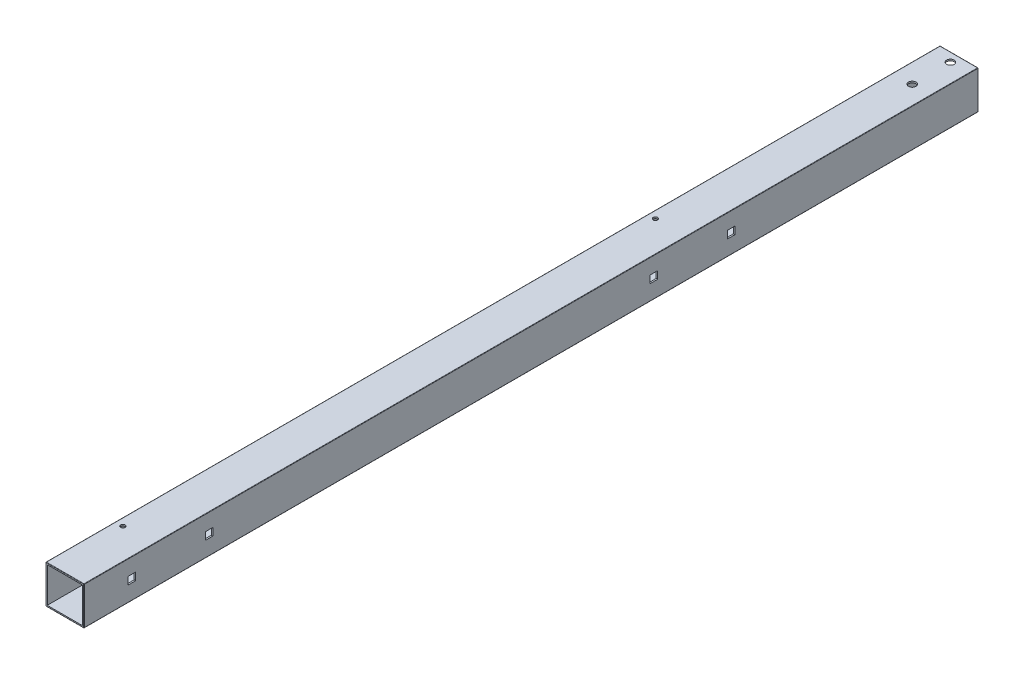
ISO-10303-21;
HEADER;
FILE_DESCRIPTION(('STEP AP214'),'2;1');
FILE_NAME('part.step','',(''),(''),'','','');
FILE_SCHEMA(('AUTOMOTIVE_DESIGN { 1 0 10303 214 1 1 1 1 }'));
ENDSEC;
DATA;
#1=APPLICATION_CONTEXT('core data for automotive mechanical design processes');
#2=APPLICATION_PROTOCOL_DEFINITION('international standard','automotive_design',2000,#1);
#3=PRODUCT_CONTEXT('',#1,'mechanical');
#4=PRODUCT('Part','Part','',(#3));
#5=PRODUCT_RELATED_PRODUCT_CATEGORY('part','',(#4));
#6=PRODUCT_DEFINITION_FORMATION('','',#4);
#7=PRODUCT_DEFINITION_CONTEXT('part definition',#1,'design');
#8=PRODUCT_DEFINITION('design','',#6,#7);
#9=PRODUCT_DEFINITION_SHAPE('','',#8);
#10=(LENGTH_UNIT() NAMED_UNIT(*) SI_UNIT(.MILLI.,.METRE.));
#11=(NAMED_UNIT(*) PLANE_ANGLE_UNIT() SI_UNIT($,.RADIAN.));
#12=(NAMED_UNIT(*) SI_UNIT($,.STERADIAN.) SOLID_ANGLE_UNIT());
#13=UNCERTAINTY_MEASURE_WITH_UNIT(LENGTH_MEASURE(1.E-05),#10,'distance_accuracy_value','');
#14=(GEOMETRIC_REPRESENTATION_CONTEXT(3) GLOBAL_UNCERTAINTY_ASSIGNED_CONTEXT((#13)) GLOBAL_UNIT_ASSIGNED_CONTEXT((#10,
#11,#12)) REPRESENTATION_CONTEXT('',''));
#15=CARTESIAN_POINT('',(0.,0.,0.));
#16=DIRECTION('',(0.,0.,1.));
#17=DIRECTION('',(1.,0.,0.));
#18=AXIS2_PLACEMENT_3D('',#15,#16,#17);
#19=CARTESIAN_POINT('',(0.,51.,1194.));
#20=DIRECTION('',(0.,0.,-1.));
#21=DIRECTION('',(-1.,0.,0.));
#22=AXIS2_PLACEMENT_3D('',#19,#20,#21);
#23=PLANE('',#22);
#24=DIRECTION('',(0.,-1.,0.));
#25=VECTOR('',#24,1.);
#26=CARTESIAN_POINT('',(0.5,51.,1194.));
#27=LINE('',#26,#25);
#28=CARTESIAN_POINT('',(0.5,50.5,1194.));
#29=VERTEX_POINT('',#28);
#30=CARTESIAN_POINT('',(0.5,0.5,1194.));
#31=VERTEX_POINT('',#30);
#32=EDGE_CURVE('E613',#29,#31,#27,.T.);
#33=ORIENTED_EDGE('',*,*,#32,.T.);
#34=DIRECTION('',(1.,0.,0.));
#35=VECTOR('',#34,1.);
#36=CARTESIAN_POINT('',(0.,0.5,1194.));
#37=LINE('',#36,#35);
#38=CARTESIAN_POINT('',(50.5,0.5,1194.));
#39=VERTEX_POINT('',#38);
#40=EDGE_CURVE('E617',#31,#39,#37,.T.);
#41=ORIENTED_EDGE('',*,*,#40,.T.);
#42=DIRECTION('',(0.,1.,0.));
#43=VECTOR('',#42,1.);
#44=CARTESIAN_POINT('',(50.5,51.,1194.));
#45=LINE('',#44,#43);
#46=CARTESIAN_POINT('',(50.5,50.5,1194.));
#47=VERTEX_POINT('',#46);
#48=EDGE_CURVE('E615',#39,#47,#45,.T.);
#49=ORIENTED_EDGE('',*,*,#48,.T.);
#50=DIRECTION('',(-1.,0.,0.));
#51=VECTOR('',#50,1.);
#52=CARTESIAN_POINT('',(0.,50.5,1194.));
#53=LINE('',#52,#51);
#54=EDGE_CURVE('E611',#47,#29,#53,.T.);
#55=ORIENTED_EDGE('',*,*,#54,.T.);
#56=EDGE_LOOP('',(#33,#41,#49,#55));
#57=FACE_BOUND('',#56,.T.);
#58=DIRECTION('',(0.,-1.,0.));
#59=VECTOR('',#58,1.);
#60=CARTESIAN_POINT('',(2.,2.,1194.));
#61=LINE('',#60,#59);
#62=CARTESIAN_POINT('',(2.,49.,1194.));
#63=VERTEX_POINT('',#62);
#64=CARTESIAN_POINT('',(2.,2.,1194.));
#65=VERTEX_POINT('',#64);
#66=EDGE_CURVE('E545',#63,#65,#61,.T.);
#67=ORIENTED_EDGE('',*,*,#66,.F.);
#68=DIRECTION('',(-1.,0.,0.));
#69=VECTOR('',#68,1.);
#70=CARTESIAN_POINT('',(2.,49.,1194.));
#71=LINE('',#70,#69);
#72=CARTESIAN_POINT('',(49.,49.,1194.));
#73=VERTEX_POINT('',#72);
#74=EDGE_CURVE('E553',#73,#63,#71,.T.);
#75=ORIENTED_EDGE('',*,*,#74,.F.);
#76=DIRECTION('',(0.,1.,0.));
#77=VECTOR('',#76,1.);
#78=CARTESIAN_POINT('',(49.,2.,1194.));
#79=LINE('',#78,#77);
#80=CARTESIAN_POINT('',(49.,2.,1194.));
#81=VERTEX_POINT('',#80);
#82=EDGE_CURVE('E550',#81,#73,#79,.T.);
#83=ORIENTED_EDGE('',*,*,#82,.F.);
#84=DIRECTION('',(1.,0.,0.));
#85=VECTOR('',#84,1.);
#86=CARTESIAN_POINT('',(2.,2.,1194.));
#87=LINE('',#86,#85);
#88=EDGE_CURVE('E547',#65,#81,#87,.T.);
#89=ORIENTED_EDGE('',*,*,#88,.F.);
#90=EDGE_LOOP('',(#67,#75,#83,#89));
#91=FACE_BOUND('',#90,.T.);
#92=ADVANCED_FACE('F33',(#57,#91),#23,.F.);
#93=CARTESIAN_POINT('',(0.,51.,0.));
#94=DIRECTION('',(0.,0.,-1.));
#95=DIRECTION('',(-1.,0.,0.));
#96=AXIS2_PLACEMENT_3D('',#93,#94,#95);
#97=PLANE('',#96);
#98=DIRECTION('',(0.,1.,0.));
#99=VECTOR('',#98,1.);
#100=CARTESIAN_POINT('',(50.5,0.,0.));
#101=LINE('',#100,#99);
#102=CARTESIAN_POINT('',(50.5,50.5,0.));
#103=VERTEX_POINT('',#102);
#104=CARTESIAN_POINT('',(50.5,0.5,0.));
#105=VERTEX_POINT('',#104);
#106=EDGE_CURVE('E656',#103,#105,#101,.F.);
#107=ORIENTED_EDGE('',*,*,#106,.T.);
#108=DIRECTION('',(1.,0.,0.));
#109=VECTOR('',#108,1.);
#110=CARTESIAN_POINT('',(0.,0.5,0.));
#111=LINE('',#110,#109);
#112=CARTESIAN_POINT('',(0.5,0.5,0.));
#113=VERTEX_POINT('',#112);
#114=EDGE_CURVE('E11',#105,#113,#111,.F.);
#115=ORIENTED_EDGE('',*,*,#114,.T.);
#116=DIRECTION('',(0.,-1.,0.));
#117=VECTOR('',#116,1.);
#118=CARTESIAN_POINT('',(0.5,51.,0.));
#119=LINE('',#118,#117);
#120=CARTESIAN_POINT('',(0.5,50.5,0.));
#121=VERTEX_POINT('',#120);
#122=EDGE_CURVE('E42',#113,#121,#119,.F.);
#123=ORIENTED_EDGE('',*,*,#122,.T.);
#124=DIRECTION('',(-1.,0.,0.));
#125=VECTOR('',#124,1.);
#126=CARTESIAN_POINT('',(51.,50.5,0.));
#127=LINE('',#126,#125);
#128=EDGE_CURVE('E658',#121,#103,#127,.F.);
#129=ORIENTED_EDGE('',*,*,#128,.T.);
#130=EDGE_LOOP('',(#107,#115,#123,#129));
#131=FACE_BOUND('',#130,.T.);
#132=DIRECTION('',(-1.,0.,0.));
#133=VECTOR('',#132,1.);
#134=CARTESIAN_POINT('',(2.,49.,0.));
#135=LINE('',#134,#133);
#136=CARTESIAN_POINT('',(49.,49.,0.));
#137=VERTEX_POINT('',#136);
#138=CARTESIAN_POINT('',(2.,49.,0.));
#139=VERTEX_POINT('',#138);
#140=EDGE_CURVE('E548',#137,#139,#135,.T.);
#141=ORIENTED_EDGE('',*,*,#140,.T.);
#142=DIRECTION('',(0.,-1.,0.));
#143=VECTOR('',#142,1.);
#144=CARTESIAN_POINT('',(2.,2.,0.));
#145=LINE('',#144,#143);
#146=CARTESIAN_POINT('',(2.,2.,0.));
#147=VERTEX_POINT('',#146);
#148=EDGE_CURVE('E544',#139,#147,#145,.T.);
#149=ORIENTED_EDGE('',*,*,#148,.T.);
#150=DIRECTION('',(1.,0.,0.));
#151=VECTOR('',#150,1.);
#152=CARTESIAN_POINT('',(2.,2.,0.));
#153=LINE('',#152,#151);
#154=CARTESIAN_POINT('',(49.,2.,0.));
#155=VERTEX_POINT('',#154);
#156=EDGE_CURVE('E558',#147,#155,#153,.T.);
#157=ORIENTED_EDGE('',*,*,#156,.T.);
#158=DIRECTION('',(0.,1.,0.));
#159=VECTOR('',#158,1.);
#160=CARTESIAN_POINT('',(49.,2.,0.));
#161=LINE('',#160,#159);
#162=EDGE_CURVE('E561',#155,#137,#161,.T.);
#163=ORIENTED_EDGE('',*,*,#162,.T.);
#164=EDGE_LOOP('',(#141,#149,#157,#163));
#165=FACE_BOUND('',#164,.T.);
#166=ADVANCED_FACE('F774',(#131,#165),#97,.T.);
#167=CARTESIAN_POINT('',(0.,0.,1194.));
#168=DIRECTION('',(1.,0.,0.));
#169=DIRECTION('',(0.,0.,-1.));
#170=AXIS2_PLACEMENT_3D('',#167,#168,#169);
#171=PLANE('',#170);
#172=DIRECTION('',(0.,0.,-1.));
#173=VECTOR('',#172,1.);
#174=CARTESIAN_POINT('',(0.,0.5,1194.));
#175=LINE('',#174,#173);
#176=CARTESIAN_POINT('',(0.,0.5,0.499999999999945));
#177=VERTEX_POINT('',#176);
#178=CARTESIAN_POINT('',(0.,0.5,1193.5));
#179=VERTEX_POINT('',#178);
#180=EDGE_CURVE('E642',#177,#179,#175,.F.);
#181=ORIENTED_EDGE('',*,*,#180,.T.);
#182=DIRECTION('',(0.,-1.,0.));
#183=VECTOR('',#182,1.);
#184=CARTESIAN_POINT('',(0.,0.,1193.5));
#185=LINE('',#184,#183);
#186=CARTESIAN_POINT('',(0.,50.5,1193.5));
#187=VERTEX_POINT('',#186);
#188=EDGE_CURVE('E644',#179,#187,#185,.F.);
#189=ORIENTED_EDGE('',*,*,#188,.T.);
#190=DIRECTION('',(0.,0.,-1.));
#191=VECTOR('',#190,1.);
#192=CARTESIAN_POINT('',(0.,50.5,1194.));
#193=LINE('',#192,#191);
#194=CARTESIAN_POINT('',(0.,50.5,0.499999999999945));
#195=VERTEX_POINT('',#194);
#196=EDGE_CURVE('E638',#187,#195,#193,.T.);
#197=ORIENTED_EDGE('',*,*,#196,.T.);
#198=DIRECTION('',(0.,-1.,0.));
#199=VECTOR('',#198,1.);
#200=CARTESIAN_POINT('',(0.,0.,0.499999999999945));
#201=LINE('',#200,#199);
#202=EDGE_CURVE('E640',#195,#177,#201,.T.);
#203=ORIENTED_EDGE('',*,*,#202,.T.);
#204=EDGE_LOOP('',(#181,#189,#197,#203));
#205=FACE_BOUND('',#204,.T.);
#206=DIRECTION('',(0.,1.,0.));
#207=VECTOR('',#206,1.);
#208=CARTESIAN_POINT('',(0.,30.4999999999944,1125.));
#209=LINE('',#208,#207);
#210=CARTESIAN_POINT('',(0.,20.4999999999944,1125.));
#211=VERTEX_POINT('',#210);
#212=CARTESIAN_POINT('',(0.,30.4999999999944,1125.));
#213=VERTEX_POINT('',#212);
#214=EDGE_CURVE('E368',#211,#213,#209,.T.);
#215=ORIENTED_EDGE('',*,*,#214,.T.);
#216=DIRECTION('',(0.,0.,1.));
#217=VECTOR('',#216,1.);
#218=CARTESIAN_POINT('',(0.,30.4999999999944,1135.));
#219=LINE('',#218,#217);
#220=CARTESIAN_POINT('',(0.,30.4999999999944,1135.));
#221=VERTEX_POINT('',#220);
#222=EDGE_CURVE('E346',#213,#221,#219,.T.);
#223=ORIENTED_EDGE('',*,*,#222,.T.);
#224=DIRECTION('',(0.,-1.,0.));
#225=VECTOR('',#224,1.);
#226=CARTESIAN_POINT('',(0.,30.4999999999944,1135.));
#227=LINE('',#226,#225);
#228=CARTESIAN_POINT('',(0.,20.4999999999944,1135.));
#229=VERTEX_POINT('',#228);
#230=EDGE_CURVE('E357',#221,#229,#227,.T.);
#231=ORIENTED_EDGE('',*,*,#230,.T.);
#232=DIRECTION('',(0.,0.,-1.));
#233=VECTOR('',#232,1.);
#234=CARTESIAN_POINT('',(0.,20.4999999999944,1135.));
#235=LINE('',#234,#233);
#236=EDGE_CURVE('E363',#229,#211,#235,.T.);
#237=ORIENTED_EDGE('',*,*,#236,.T.);
#238=EDGE_LOOP('',(#215,#223,#231,#237));
#239=FACE_BOUND('',#238,.T.);
#240=DIRECTION('',(0.,1.,0.));
#241=VECTOR('',#240,1.);
#242=CARTESIAN_POINT('',(0.,30.4999999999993,428.));
#243=LINE('',#242,#241);
#244=CARTESIAN_POINT('',(0.,20.4999999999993,428.));
#245=VERTEX_POINT('',#244);
#246=CARTESIAN_POINT('',(0.,30.4999999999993,428.));
#247=VERTEX_POINT('',#246);
#248=EDGE_CURVE('E414',#245,#247,#243,.T.);
#249=ORIENTED_EDGE('',*,*,#248,.T.);
#250=DIRECTION('',(0.,0.,1.));
#251=VECTOR('',#250,1.);
#252=CARTESIAN_POINT('',(0.,30.4999999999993,438.));
#253=LINE('',#252,#251);
#254=CARTESIAN_POINT('',(0.,30.4999999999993,438.));
#255=VERTEX_POINT('',#254);
#256=EDGE_CURVE('E404',#247,#255,#253,.T.);
#257=ORIENTED_EDGE('',*,*,#256,.T.);
#258=DIRECTION('',(0.,-1.,0.));
#259=VECTOR('',#258,1.);
#260=CARTESIAN_POINT('',(0.,30.4999999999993,438.));
#261=LINE('',#260,#259);
#262=CARTESIAN_POINT('',(0.,20.4999999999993,438.));
#263=VERTEX_POINT('',#262);
#264=EDGE_CURVE('E407',#255,#263,#261,.T.);
#265=ORIENTED_EDGE('',*,*,#264,.T.);
#266=DIRECTION('',(0.,0.,-1.));
#267=VECTOR('',#266,1.);
#268=CARTESIAN_POINT('',(0.,20.4999999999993,438.));
#269=LINE('',#268,#267);
#270=EDGE_CURVE('E411',#263,#245,#269,.T.);
#271=ORIENTED_EDGE('',*,*,#270,.T.);
#272=EDGE_LOOP('',(#249,#257,#265,#271));
#273=FACE_BOUND('',#272,.T.);
#274=DIRECTION('',(0.,0.,1.));
#275=VECTOR('',#274,1.);
#276=CARTESIAN_POINT('',(0.,30.4999999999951,1032.));
#277=LINE('',#276,#275);
#278=CARTESIAN_POINT('',(0.,30.4999999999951,1022.));
#279=VERTEX_POINT('',#278);
#280=CARTESIAN_POINT('',(0.,30.4999999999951,1032.));
#281=VERTEX_POINT('',#280);
#282=EDGE_CURVE('E461',#279,#281,#277,.T.);
#283=ORIENTED_EDGE('',*,*,#282,.T.);
#284=DIRECTION('',(0.,-1.,0.));
#285=VECTOR('',#284,1.);
#286=CARTESIAN_POINT('',(0.,30.4999999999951,1032.));
#287=LINE('',#286,#285);
#288=CARTESIAN_POINT('',(0.,20.4999999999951,1032.));
#289=VERTEX_POINT('',#288);
#290=EDGE_CURVE('E451',#281,#289,#287,.T.);
#291=ORIENTED_EDGE('',*,*,#290,.T.);
#292=DIRECTION('',(0.,0.,-1.));
#293=VECTOR('',#292,1.);
#294=CARTESIAN_POINT('',(0.,20.4999999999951,1032.));
#295=LINE('',#294,#293);
#296=CARTESIAN_POINT('',(0.,20.4999999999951,1022.));
#297=VERTEX_POINT('',#296);
#298=EDGE_CURVE('E454',#289,#297,#295,.T.);
#299=ORIENTED_EDGE('',*,*,#298,.T.);
#300=DIRECTION('',(0.,1.,0.));
#301=VECTOR('',#300,1.);
#302=CARTESIAN_POINT('',(0.,30.4999999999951,1022.));
#303=LINE('',#302,#301);
#304=EDGE_CURVE('E458',#297,#279,#303,.T.);
#305=ORIENTED_EDGE('',*,*,#304,.T.);
#306=EDGE_LOOP('',(#283,#291,#299,#305));
#307=FACE_BOUND('',#306,.T.);
#308=DIRECTION('',(0.,0.,1.));
#309=VECTOR('',#308,1.);
#310=CARTESIAN_POINT('',(0.,30.5,335.));
#311=LINE('',#310,#309);
#312=CARTESIAN_POINT('',(0.,30.5,325.));
#313=VERTEX_POINT('',#312);
#314=CARTESIAN_POINT('',(0.,30.5,335.));
#315=VERTEX_POINT('',#314);
#316=EDGE_CURVE('E508',#313,#315,#311,.T.);
#317=ORIENTED_EDGE('',*,*,#316,.T.);
#318=DIRECTION('',(0.,-1.,0.));
#319=VECTOR('',#318,1.);
#320=CARTESIAN_POINT('',(0.,30.5,335.));
#321=LINE('',#320,#319);
#322=CARTESIAN_POINT('',(0.,20.5,335.));
#323=VERTEX_POINT('',#322);
#324=EDGE_CURVE('E498',#315,#323,#321,.T.);
#325=ORIENTED_EDGE('',*,*,#324,.T.);
#326=DIRECTION('',(0.,0.,-1.));
#327=VECTOR('',#326,1.);
#328=CARTESIAN_POINT('',(0.,20.5,335.));
#329=LINE('',#328,#327);
#330=CARTESIAN_POINT('',(0.,20.5,325.));
#331=VERTEX_POINT('',#330);
#332=EDGE_CURVE('E501',#323,#331,#329,.T.);
#333=ORIENTED_EDGE('',*,*,#332,.T.);
#334=DIRECTION('',(0.,1.,0.));
#335=VECTOR('',#334,1.);
#336=CARTESIAN_POINT('',(0.,30.5,325.));
#337=LINE('',#336,#335);
#338=EDGE_CURVE('E505',#331,#313,#337,.T.);
#339=ORIENTED_EDGE('',*,*,#338,.T.);
#340=EDGE_LOOP('',(#317,#325,#333,#339));
#341=FACE_BOUND('',#340,.T.);
#342=ADVANCED_FACE('F365',(#205,#239,#273,#307,#341),#171,.F.);
#343=CARTESIAN_POINT('',(0.,0.,1194.));
#344=DIRECTION('',(0.,1.,0.));
#345=DIRECTION('',(0.,0.,1.));
#346=AXIS2_PLACEMENT_3D('',#343,#344,#345);
#347=PLANE('',#346);
#348=DIRECTION('',(0.,0.,-1.));
#349=VECTOR('',#348,1.);
#350=CARTESIAN_POINT('',(50.5,0.,1194.));
#351=LINE('',#350,#349);
#352=CARTESIAN_POINT('',(50.5,0.,0.499999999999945));
#353=VERTEX_POINT('',#352);
#354=CARTESIAN_POINT('',(50.5,0.,1193.5));
#355=VERTEX_POINT('',#354);
#356=EDGE_CURVE('E620',#353,#355,#351,.F.);
#357=ORIENTED_EDGE('',*,*,#356,.T.);
#358=DIRECTION('',(1.,0.,0.));
#359=VECTOR('',#358,1.);
#360=CARTESIAN_POINT('',(0.,0.,1193.5));
#361=LINE('',#360,#359);
#362=CARTESIAN_POINT('',(0.5,0.,1193.5));
#363=VERTEX_POINT('',#362);
#364=EDGE_CURVE('E626',#355,#363,#361,.F.);
#365=ORIENTED_EDGE('',*,*,#364,.T.);
#366=DIRECTION('',(0.,0.,-1.));
#367=VECTOR('',#366,1.);
#368=CARTESIAN_POINT('',(0.5,0.,1194.));
#369=LINE('',#368,#367);
#370=CARTESIAN_POINT('',(0.5,0.,0.499999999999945));
#371=VERTEX_POINT('',#370);
#372=EDGE_CURVE('E624',#363,#371,#369,.T.);
#373=ORIENTED_EDGE('',*,*,#372,.T.);
#374=DIRECTION('',(1.,0.,0.));
#375=VECTOR('',#374,1.);
#376=CARTESIAN_POINT('',(51.,0.,0.499999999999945));
#377=LINE('',#376,#375);
#378=EDGE_CURVE('E622',#371,#353,#377,.T.);
#379=ORIENTED_EDGE('',*,*,#378,.T.);
#380=EDGE_LOOP('',(#357,#365,#373,#379));
#381=FACE_BOUND('',#380,.T.);
#382=ADVANCED_FACE('F793',(#381),#347,.F.);
#383=CARTESIAN_POINT('',(51.,0.,1194.));
#384=DIRECTION('',(-1.,0.,0.));
#385=DIRECTION('',(0.,0.,1.));
#386=AXIS2_PLACEMENT_3D('',#383,#384,#385);
#387=PLANE('',#386);
#388=DIRECTION('',(0.,1.,0.));
#389=VECTOR('',#388,1.);
#390=CARTESIAN_POINT('',(51.,0.,1193.5));
#391=LINE('',#390,#389);
#392=CARTESIAN_POINT('',(51.,50.5,1193.5));
#393=VERTEX_POINT('',#392);
#394=CARTESIAN_POINT('',(51.,0.5,1193.5));
#395=VERTEX_POINT('',#394);
#396=EDGE_CURVE('E633',#393,#395,#391,.F.);
#397=ORIENTED_EDGE('',*,*,#396,.T.);
#398=DIRECTION('',(0.,0.,-1.));
#399=VECTOR('',#398,1.);
#400=CARTESIAN_POINT('',(51.,0.5,1194.));
#401=LINE('',#400,#399);
#402=CARTESIAN_POINT('',(51.,0.5,0.499999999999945));
#403=VERTEX_POINT('',#402);
#404=EDGE_CURVE('E636',#395,#403,#401,.T.);
#405=ORIENTED_EDGE('',*,*,#404,.T.);
#406=DIRECTION('',(0.,1.,0.));
#407=VECTOR('',#406,1.);
#408=CARTESIAN_POINT('',(51.,51.,0.499999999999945));
#409=LINE('',#408,#407);
#410=CARTESIAN_POINT('',(51.,50.5,0.499999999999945));
#411=VERTEX_POINT('',#410);
#412=EDGE_CURVE('E631',#403,#411,#409,.T.);
#413=ORIENTED_EDGE('',*,*,#412,.T.);
#414=DIRECTION('',(0.,0.,-1.));
#415=VECTOR('',#414,1.);
#416=CARTESIAN_POINT('',(51.,50.5,1194.));
#417=LINE('',#416,#415);
#418=EDGE_CURVE('E629',#411,#393,#417,.F.);
#419=ORIENTED_EDGE('',*,*,#418,.T.);
#420=EDGE_LOOP('',(#397,#405,#413,#419));
#421=FACE_BOUND('',#420,.T.);
#422=DIRECTION('',(0.,-1.,0.));
#423=VECTOR('',#422,1.);
#424=CARTESIAN_POINT('',(51.,30.4999999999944,1135.));
#425=LINE('',#424,#423);
#426=CARTESIAN_POINT('',(51.,30.4999999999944,1135.));
#427=VERTEX_POINT('',#426);
#428=CARTESIAN_POINT('',(51.,20.4999999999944,1135.));
#429=VERTEX_POINT('',#428);
#430=EDGE_CURVE('E382',#427,#429,#425,.T.);
#431=ORIENTED_EDGE('',*,*,#430,.F.);
#432=DIRECTION('',(0.,0.,1.));
#433=VECTOR('',#432,1.);
#434=CARTESIAN_POINT('',(51.,30.4999999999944,1135.));
#435=LINE('',#434,#433);
#436=CARTESIAN_POINT('',(51.,30.4999999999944,1125.));
#437=VERTEX_POINT('',#436);
#438=EDGE_CURVE('E380',#437,#427,#435,.T.);
#439=ORIENTED_EDGE('',*,*,#438,.F.);
#440=DIRECTION('',(0.,1.,0.));
#441=VECTOR('',#440,1.);
#442=CARTESIAN_POINT('',(51.,30.4999999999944,1125.));
#443=LINE('',#442,#441);
#444=CARTESIAN_POINT('',(51.,20.4999999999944,1125.));
#445=VERTEX_POINT('',#444);
#446=EDGE_CURVE('E369',#445,#437,#443,.T.);
#447=ORIENTED_EDGE('',*,*,#446,.F.);
#448=DIRECTION('',(0.,0.,-1.));
#449=VECTOR('',#448,1.);
#450=CARTESIAN_POINT('',(51.,20.4999999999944,1135.));
#451=LINE('',#450,#449);
#452=EDGE_CURVE('E372',#429,#445,#451,.T.);
#453=ORIENTED_EDGE('',*,*,#452,.F.);
#454=EDGE_LOOP('',(#431,#439,#447,#453));
#455=FACE_BOUND('',#454,.T.);
#456=DIRECTION('',(0.,-1.,0.));
#457=VECTOR('',#456,1.);
#458=CARTESIAN_POINT('',(51.,30.4999999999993,438.));
#459=LINE('',#458,#457);
#460=CARTESIAN_POINT('',(51.,30.4999999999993,438.));
#461=VERTEX_POINT('',#460);
#462=CARTESIAN_POINT('',(51.,20.4999999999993,438.));
#463=VERTEX_POINT('',#462);
#464=EDGE_CURVE('E419',#461,#463,#459,.T.);
#465=ORIENTED_EDGE('',*,*,#464,.F.);
#466=DIRECTION('',(0.,0.,1.));
#467=VECTOR('',#466,1.);
#468=CARTESIAN_POINT('',(51.,30.4999999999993,438.));
#469=LINE('',#468,#467);
#470=CARTESIAN_POINT('',(51.,30.4999999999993,428.));
#471=VERTEX_POINT('',#470);
#472=EDGE_CURVE('E403',#471,#461,#469,.T.);
#473=ORIENTED_EDGE('',*,*,#472,.F.);
#474=DIRECTION('',(0.,1.,0.));
#475=VECTOR('',#474,1.);
#476=CARTESIAN_POINT('',(51.,30.4999999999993,428.));
#477=LINE('',#476,#475);
#478=CARTESIAN_POINT('',(51.,20.4999999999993,428.));
#479=VERTEX_POINT('',#478);
#480=EDGE_CURVE('E408',#479,#471,#477,.T.);
#481=ORIENTED_EDGE('',*,*,#480,.F.);
#482=DIRECTION('',(0.,0.,-1.));
#483=VECTOR('',#482,1.);
#484=CARTESIAN_POINT('',(51.,20.4999999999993,438.));
#485=LINE('',#484,#483);
#486=EDGE_CURVE('E422',#463,#479,#485,.T.);
#487=ORIENTED_EDGE('',*,*,#486,.F.);
#488=EDGE_LOOP('',(#465,#473,#481,#487));
#489=FACE_BOUND('',#488,.T.);
#490=DIRECTION('',(0.,0.,-1.));
#491=VECTOR('',#490,1.);
#492=CARTESIAN_POINT('',(51.,20.4999999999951,1032.));
#493=LINE('',#492,#491);
#494=CARTESIAN_POINT('',(51.,20.4999999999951,1032.));
#495=VERTEX_POINT('',#494);
#496=CARTESIAN_POINT('',(51.,20.4999999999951,1022.));
#497=VERTEX_POINT('',#496);
#498=EDGE_CURVE('E466',#495,#497,#493,.T.);
#499=ORIENTED_EDGE('',*,*,#498,.F.);
#500=DIRECTION('',(0.,-1.,0.));
#501=VECTOR('',#500,1.);
#502=CARTESIAN_POINT('',(51.,30.4999999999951,1032.));
#503=LINE('',#502,#501);
#504=CARTESIAN_POINT('',(51.,30.4999999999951,1032.));
#505=VERTEX_POINT('',#504);
#506=EDGE_CURVE('E450',#505,#495,#503,.T.);
#507=ORIENTED_EDGE('',*,*,#506,.F.);
#508=DIRECTION('',(0.,0.,1.));
#509=VECTOR('',#508,1.);
#510=CARTESIAN_POINT('',(51.,30.4999999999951,1032.));
#511=LINE('',#510,#509);
#512=CARTESIAN_POINT('',(51.,30.4999999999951,1022.));
#513=VERTEX_POINT('',#512);
#514=EDGE_CURVE('E455',#513,#505,#511,.T.);
#515=ORIENTED_EDGE('',*,*,#514,.F.);
#516=DIRECTION('',(0.,1.,0.));
#517=VECTOR('',#516,1.);
#518=CARTESIAN_POINT('',(51.,30.4999999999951,1022.));
#519=LINE('',#518,#517);
#520=EDGE_CURVE('E469',#497,#513,#519,.T.);
#521=ORIENTED_EDGE('',*,*,#520,.F.);
#522=EDGE_LOOP('',(#499,#507,#515,#521));
#523=FACE_BOUND('',#522,.T.);
#524=DIRECTION('',(0.,0.,-1.));
#525=VECTOR('',#524,1.);
#526=CARTESIAN_POINT('',(51.,20.5,335.));
#527=LINE('',#526,#525);
#528=CARTESIAN_POINT('',(51.,20.5,335.));
#529=VERTEX_POINT('',#528);
#530=CARTESIAN_POINT('',(51.,20.5,325.));
#531=VERTEX_POINT('',#530);
#532=EDGE_CURVE('E513',#529,#531,#527,.T.);
#533=ORIENTED_EDGE('',*,*,#532,.F.);
#534=DIRECTION('',(0.,-1.,0.));
#535=VECTOR('',#534,1.);
#536=CARTESIAN_POINT('',(51.,30.5,335.));
#537=LINE('',#536,#535);
#538=CARTESIAN_POINT('',(51.,30.5,335.));
#539=VERTEX_POINT('',#538);
#540=EDGE_CURVE('E497',#539,#529,#537,.T.);
#541=ORIENTED_EDGE('',*,*,#540,.F.);
#542=DIRECTION('',(0.,0.,1.));
#543=VECTOR('',#542,1.);
#544=CARTESIAN_POINT('',(51.,30.5,335.));
#545=LINE('',#544,#543);
#546=CARTESIAN_POINT('',(51.,30.5,325.));
#547=VERTEX_POINT('',#546);
#548=EDGE_CURVE('E502',#547,#539,#545,.T.);
#549=ORIENTED_EDGE('',*,*,#548,.F.);
#550=DIRECTION('',(0.,1.,0.));
#551=VECTOR('',#550,1.);
#552=CARTESIAN_POINT('',(51.,30.5,325.));
#553=LINE('',#552,#551);
#554=EDGE_CURVE('E516',#531,#547,#553,.T.);
#555=ORIENTED_EDGE('',*,*,#554,.F.);
#556=EDGE_LOOP('',(#533,#541,#549,#555));
#557=FACE_BOUND('',#556,.T.);
#558=ADVANCED_FACE('F789',(#421,#455,#489,#523,#557),#387,.F.);
#559=CARTESIAN_POINT('',(0.,51.,1194.));
#560=DIRECTION('',(0.,-1.,0.));
#561=DIRECTION('',(0.,0.,-1.));
#562=AXIS2_PLACEMENT_3D('',#559,#560,#561);
#563=PLANE('',#562);
#564=DIRECTION('',(-1.,0.,0.));
#565=VECTOR('',#564,1.);
#566=CARTESIAN_POINT('',(0.,51.,0.499999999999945));
#567=LINE('',#566,#565);
#568=CARTESIAN_POINT('',(50.5,51.,0.499999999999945));
#569=VERTEX_POINT('',#568);
#570=CARTESIAN_POINT('',(0.5,51.,0.499999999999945));
#571=VERTEX_POINT('',#570);
#572=EDGE_CURVE('E649',#569,#571,#567,.T.);
#573=ORIENTED_EDGE('',*,*,#572,.T.);
#574=DIRECTION('',(0.,0.,-1.));
#575=VECTOR('',#574,1.);
#576=CARTESIAN_POINT('',(0.5,51.,1194.));
#577=LINE('',#576,#575);
#578=CARTESIAN_POINT('',(0.5,51.,1193.5));
#579=VERTEX_POINT('',#578);
#580=EDGE_CURVE('E654',#571,#579,#577,.F.);
#581=ORIENTED_EDGE('',*,*,#580,.T.);
#582=DIRECTION('',(-1.,0.,0.));
#583=VECTOR('',#582,1.);
#584=CARTESIAN_POINT('',(0.,51.,1193.5));
#585=LINE('',#584,#583);
#586=CARTESIAN_POINT('',(50.5,51.,1193.5));
#587=VERTEX_POINT('',#586);
#588=EDGE_CURVE('E651',#579,#587,#585,.F.);
#589=ORIENTED_EDGE('',*,*,#588,.T.);
#590=DIRECTION('',(0.,0.,-1.));
#591=VECTOR('',#590,1.);
#592=CARTESIAN_POINT('',(50.5,51.,1194.));
#593=LINE('',#592,#591);
#594=EDGE_CURVE('E647',#587,#569,#593,.T.);
#595=ORIENTED_EDGE('',*,*,#594,.T.);
#596=EDGE_LOOP('',(#573,#581,#589,#595));
#597=FACE_BOUND('',#596,.T.);
#598=CARTESIAN_POINT('',(25.9,51.,63.));
#599=DIRECTION('',(0.,1.,0.));
#600=DIRECTION('',(0.,0.,1.));
#601=AXIS2_PLACEMENT_3D('',#598,#599,#600);
#602=CIRCLE('',#601,5.);
#603=CARTESIAN_POINT('',(25.9,51.,68.));
#604=VERTEX_POINT('',#603);
#605=EDGE_CURVE('E731',#604,#604,#602,.T.);
#606=ORIENTED_EDGE('',*,*,#605,.F.);
#607=EDGE_LOOP('',(#606));
#608=FACE_BOUND('',#607,.T.);
#609=CARTESIAN_POINT('',(25.9,51.,12.));
#610=DIRECTION('',(0.,1.,0.));
#611=DIRECTION('',(0.,0.,1.));
#612=AXIS2_PLACEMENT_3D('',#609,#610,#611);
#613=CIRCLE('',#612,5.);
#614=CARTESIAN_POINT('',(25.9,51.,17.));
#615=VERTEX_POINT('',#614);
#616=EDGE_CURVE('E739',#615,#615,#613,.T.);
#617=ORIENTED_EDGE('',*,*,#616,.F.);
#618=EDGE_LOOP('',(#617));
#619=FACE_BOUND('',#618,.T.);
#620=CARTESIAN_POINT('',(10.,51.,390.));
#621=DIRECTION('',(0.,1.,0.));
#622=DIRECTION('',(0.,0.,1.));
#623=AXIS2_PLACEMENT_3D('',#620,#621,#622);
#624=CIRCLE('',#623,3.);
#625=CARTESIAN_POINT('',(10.,51.,393.));
#626=VERTEX_POINT('',#625);
#627=EDGE_CURVE('E745',#626,#626,#624,.T.);
#628=ORIENTED_EDGE('',*,*,#627,.F.);
#629=EDGE_LOOP('',(#628));
#630=FACE_BOUND('',#629,.T.);
#631=CARTESIAN_POINT('',(10.,51.,1101.));
#632=DIRECTION('',(0.,1.,0.));
#633=DIRECTION('',(0.,0.,1.));
#634=AXIS2_PLACEMENT_3D('',#631,#632,#633);
#635=CIRCLE('',#634,3.);
#636=CARTESIAN_POINT('',(10.,51.,1104.));
#637=VERTEX_POINT('',#636);
#638=EDGE_CURVE('E383',#637,#637,#635,.T.);
#639=ORIENTED_EDGE('',*,*,#638,.F.);
#640=EDGE_LOOP('',(#639));
#641=FACE_BOUND('',#640,.T.);
#642=ADVANCED_FACE('F786',(#597,#608,#619,#630,#641),#563,.F.);
#643=CARTESIAN_POINT('',(2.,2.,1194.));
#644=DIRECTION('',(1.,0.,0.));
#645=DIRECTION('',(0.,0.,-1.));
#646=AXIS2_PLACEMENT_3D('',#643,#644,#645);
#647=PLANE('',#646);
#648=DIRECTION('',(0.,0.,1.));
#649=VECTOR('',#648,1.);
#650=CARTESIAN_POINT('',(2.,30.4999999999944,1194.));
#651=LINE('',#650,#649);
#652=CARTESIAN_POINT('',(2.,30.4999999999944,1125.));
#653=VERTEX_POINT('',#652);
#654=CARTESIAN_POINT('',(2.,30.4999999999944,1135.));
#655=VERTEX_POINT('',#654);
#656=EDGE_CURVE('E349',#653,#655,#651,.T.);
#657=ORIENTED_EDGE('',*,*,#656,.F.);
#658=DIRECTION('',(0.,1.,0.));
#659=VECTOR('',#658,1.);
#660=CARTESIAN_POINT('',(2.,2.,1125.));
#661=LINE('',#660,#659);
#662=CARTESIAN_POINT('',(2.,20.4999999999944,1125.));
#663=VERTEX_POINT('',#662);
#664=EDGE_CURVE('E400',#663,#653,#661,.T.);
#665=ORIENTED_EDGE('',*,*,#664,.F.);
#666=DIRECTION('',(0.,0.,-1.));
#667=VECTOR('',#666,1.);
#668=CARTESIAN_POINT('',(2.,20.4999999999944,1194.));
#669=LINE('',#668,#667);
#670=CARTESIAN_POINT('',(2.,20.4999999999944,1135.));
#671=VERTEX_POINT('',#670);
#672=EDGE_CURVE('E398',#671,#663,#669,.T.);
#673=ORIENTED_EDGE('',*,*,#672,.F.);
#674=DIRECTION('',(0.,-1.,0.));
#675=VECTOR('',#674,1.);
#676=CARTESIAN_POINT('',(2.,2.,1135.));
#677=LINE('',#676,#675);
#678=EDGE_CURVE('E390',#655,#671,#677,.T.);
#679=ORIENTED_EDGE('',*,*,#678,.F.);
#680=EDGE_LOOP('',(#657,#665,#673,#679));
#681=FACE_BOUND('',#680,.T.);
#682=DIRECTION('',(0.,0.,1.));
#683=VECTOR('',#682,1.);
#684=CARTESIAN_POINT('',(2.,30.4999999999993,1194.));
#685=LINE('',#684,#683);
#686=CARTESIAN_POINT('',(2.,30.4999999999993,428.));
#687=VERTEX_POINT('',#686);
#688=CARTESIAN_POINT('',(2.,30.4999999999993,438.));
#689=VERTEX_POINT('',#688);
#690=EDGE_CURVE('E447',#687,#689,#685,.T.);
#691=ORIENTED_EDGE('',*,*,#690,.F.);
#692=DIRECTION('',(0.,1.,0.));
#693=VECTOR('',#692,1.);
#694=CARTESIAN_POINT('',(2.,2.,428.));
#695=LINE('',#694,#693);
#696=CARTESIAN_POINT('',(2.,20.4999999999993,428.));
#697=VERTEX_POINT('',#696);
#698=EDGE_CURVE('E445',#697,#687,#695,.T.);
#699=ORIENTED_EDGE('',*,*,#698,.F.);
#700=DIRECTION('',(0.,0.,-1.));
#701=VECTOR('',#700,1.);
#702=CARTESIAN_POINT('',(2.,20.499999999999,1194.));
#703=LINE('',#702,#701);
#704=CARTESIAN_POINT('',(2.,20.4999999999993,438.));
#705=VERTEX_POINT('',#704);
#706=EDGE_CURVE('E443',#705,#697,#703,.T.);
#707=ORIENTED_EDGE('',*,*,#706,.F.);
#708=DIRECTION('',(0.,-1.,0.));
#709=VECTOR('',#708,1.);
#710=CARTESIAN_POINT('',(2.,2.,438.));
#711=LINE('',#710,#709);
#712=EDGE_CURVE('E430',#689,#705,#711,.T.);
#713=ORIENTED_EDGE('',*,*,#712,.F.);
#714=EDGE_LOOP('',(#691,#699,#707,#713));
#715=FACE_BOUND('',#714,.T.);
#716=DIRECTION('',(0.,-1.,0.));
#717=VECTOR('',#716,1.);
#718=CARTESIAN_POINT('',(2.,2.,1032.));
#719=LINE('',#718,#717);
#720=CARTESIAN_POINT('',(2.,30.4999999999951,1032.));
#721=VERTEX_POINT('',#720);
#722=CARTESIAN_POINT('',(2.,20.4999999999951,1032.));
#723=VERTEX_POINT('',#722);
#724=EDGE_CURVE('E494',#721,#723,#719,.T.);
#725=ORIENTED_EDGE('',*,*,#724,.F.);
#726=DIRECTION('',(0.,0.,1.));
#727=VECTOR('',#726,1.);
#728=CARTESIAN_POINT('',(2.,30.4999999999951,1194.));
#729=LINE('',#728,#727);
#730=CARTESIAN_POINT('',(2.,30.4999999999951,1022.));
#731=VERTEX_POINT('',#730);
#732=EDGE_CURVE('E492',#731,#721,#729,.T.);
#733=ORIENTED_EDGE('',*,*,#732,.F.);
#734=DIRECTION('',(0.,1.,0.));
#735=VECTOR('',#734,1.);
#736=CARTESIAN_POINT('',(2.,2.,1022.));
#737=LINE('',#736,#735);
#738=CARTESIAN_POINT('',(2.,20.4999999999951,1022.));
#739=VERTEX_POINT('',#738);
#740=EDGE_CURVE('E490',#739,#731,#737,.T.);
#741=ORIENTED_EDGE('',*,*,#740,.F.);
#742=DIRECTION('',(0.,0.,-1.));
#743=VECTOR('',#742,1.);
#744=CARTESIAN_POINT('',(2.,20.4999999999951,1194.));
#745=LINE('',#744,#743);
#746=EDGE_CURVE('E477',#723,#739,#745,.T.);
#747=ORIENTED_EDGE('',*,*,#746,.F.);
#748=EDGE_LOOP('',(#725,#733,#741,#747));
#749=FACE_BOUND('',#748,.T.);
#750=DIRECTION('',(0.,-1.,0.));
#751=VECTOR('',#750,1.);
#752=CARTESIAN_POINT('',(2.,2.,335.));
#753=LINE('',#752,#751);
#754=CARTESIAN_POINT('',(2.,30.5,335.));
#755=VERTEX_POINT('',#754);
#756=CARTESIAN_POINT('',(2.,20.5,335.));
#757=VERTEX_POINT('',#756);
#758=EDGE_CURVE('E541',#755,#757,#753,.T.);
#759=ORIENTED_EDGE('',*,*,#758,.F.);
#760=DIRECTION('',(0.,0.,1.));
#761=VECTOR('',#760,1.);
#762=CARTESIAN_POINT('',(2.,30.5,1194.));
#763=LINE('',#762,#761);
#764=CARTESIAN_POINT('',(2.,30.5,325.));
#765=VERTEX_POINT('',#764);
#766=EDGE_CURVE('E539',#765,#755,#763,.T.);
#767=ORIENTED_EDGE('',*,*,#766,.F.);
#768=DIRECTION('',(0.,1.,0.));
#769=VECTOR('',#768,1.);
#770=CARTESIAN_POINT('',(2.,2.,325.));
#771=LINE('',#770,#769);
#772=CARTESIAN_POINT('',(2.,20.5,325.));
#773=VERTEX_POINT('',#772);
#774=EDGE_CURVE('E537',#773,#765,#771,.T.);
#775=ORIENTED_EDGE('',*,*,#774,.F.);
#776=DIRECTION('',(0.,0.,-1.));
#777=VECTOR('',#776,1.);
#778=CARTESIAN_POINT('',(2.,20.4999999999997,1194.));
#779=LINE('',#778,#777);
#780=EDGE_CURVE('E524',#757,#773,#779,.T.);
#781=ORIENTED_EDGE('',*,*,#780,.F.);
#782=EDGE_LOOP('',(#759,#767,#775,#781));
#783=FACE_BOUND('',#782,.T.);
#784=ORIENTED_EDGE('',*,*,#148,.F.);
#785=DIRECTION('',(0.,0.,-1.));
#786=VECTOR('',#785,1.);
#787=CARTESIAN_POINT('',(2.,49.,1194.));
#788=LINE('',#787,#786);
#789=EDGE_CURVE('E555',#63,#139,#788,.T.);
#790=ORIENTED_EDGE('',*,*,#789,.F.);
#791=ORIENTED_EDGE('',*,*,#66,.T.);
#792=DIRECTION('',(0.,0.,-1.));
#793=VECTOR('',#792,1.);
#794=CARTESIAN_POINT('',(2.,2.,1194.));
#795=LINE('',#794,#793);
#796=EDGE_CURVE('E572',#65,#147,#795,.T.);
#797=ORIENTED_EDGE('',*,*,#796,.T.);
#798=EDGE_LOOP('',(#784,#790,#791,#797));
#799=FACE_BOUND('',#798,.T.);
#800=ADVANCED_FACE('F783',(#681,#715,#749,#783,#799),#647,.T.);
#801=CARTESIAN_POINT('',(2.,2.,1194.));
#802=DIRECTION('',(0.,1.,0.));
#803=DIRECTION('',(0.,0.,1.));
#804=AXIS2_PLACEMENT_3D('',#801,#802,#803);
#805=PLANE('',#804);
#806=ORIENTED_EDGE('',*,*,#156,.F.);
#807=ORIENTED_EDGE('',*,*,#796,.F.);
#808=ORIENTED_EDGE('',*,*,#88,.T.);
#809=DIRECTION('',(0.,0.,-1.));
#810=VECTOR('',#809,1.);
#811=CARTESIAN_POINT('',(49.,2.,1194.));
#812=LINE('',#811,#810);
#813=EDGE_CURVE('E570',#81,#155,#812,.T.);
#814=ORIENTED_EDGE('',*,*,#813,.T.);
#815=EDGE_LOOP('',(#806,#807,#808,#814));
#816=FACE_BOUND('',#815,.T.);
#817=ADVANCED_FACE('F993',(#816),#805,.T.);
#818=CARTESIAN_POINT('',(49.,2.,1194.));
#819=DIRECTION('',(-1.,0.,0.));
#820=DIRECTION('',(0.,0.,1.));
#821=AXIS2_PLACEMENT_3D('',#818,#819,#820);
#822=PLANE('',#821);
#823=DIRECTION('',(0.,0.,-1.));
#824=VECTOR('',#823,1.);
#825=CARTESIAN_POINT('',(49.,30.4999999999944,1194.));
#826=LINE('',#825,#824);
#827=CARTESIAN_POINT('',(49.,30.4999999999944,1135.));
#828=VERTEX_POINT('',#827);
#829=CARTESIAN_POINT('',(49.,30.4999999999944,1125.));
#830=VERTEX_POINT('',#829);
#831=EDGE_CURVE('E609',#828,#830,#826,.T.);
#832=ORIENTED_EDGE('',*,*,#831,.F.);
#833=DIRECTION('',(0.,1.,0.));
#834=VECTOR('',#833,1.);
#835=CARTESIAN_POINT('',(49.,2.,1135.));
#836=LINE('',#835,#834);
#837=CARTESIAN_POINT('',(49.,20.4999999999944,1135.));
#838=VERTEX_POINT('',#837);
#839=EDGE_CURVE('E602',#838,#828,#836,.T.);
#840=ORIENTED_EDGE('',*,*,#839,.F.);
#841=DIRECTION('',(0.,0.,1.));
#842=VECTOR('',#841,1.);
#843=CARTESIAN_POINT('',(49.,20.4999999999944,1194.));
#844=LINE('',#843,#842);
#845=CARTESIAN_POINT('',(49.,20.4999999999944,1125.));
#846=VERTEX_POINT('',#845);
#847=EDGE_CURVE('E604',#846,#838,#844,.T.);
#848=ORIENTED_EDGE('',*,*,#847,.F.);
#849=DIRECTION('',(0.,-1.,0.));
#850=VECTOR('',#849,1.);
#851=CARTESIAN_POINT('',(49.,2.,1125.));
#852=LINE('',#851,#850);
#853=EDGE_CURVE('E607',#830,#846,#852,.T.);
#854=ORIENTED_EDGE('',*,*,#853,.F.);
#855=EDGE_LOOP('',(#832,#840,#848,#854));
#856=FACE_BOUND('',#855,.T.);
#857=DIRECTION('',(0.,0.,-1.));
#858=VECTOR('',#857,1.);
#859=CARTESIAN_POINT('',(49.,30.4999999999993,1194.));
#860=LINE('',#859,#858);
#861=CARTESIAN_POINT('',(49.,30.4999999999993,438.));
#862=VERTEX_POINT('',#861);
#863=CARTESIAN_POINT('',(49.,30.4999999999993,428.));
#864=VERTEX_POINT('',#863);
#865=EDGE_CURVE('E600',#862,#864,#860,.T.);
#866=ORIENTED_EDGE('',*,*,#865,.F.);
#867=DIRECTION('',(0.,1.,0.));
#868=VECTOR('',#867,1.);
#869=CARTESIAN_POINT('',(49.,2.,438.));
#870=LINE('',#869,#868);
#871=CARTESIAN_POINT('',(49.,20.4999999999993,438.));
#872=VERTEX_POINT('',#871);
#873=EDGE_CURVE('E593',#872,#862,#870,.T.);
#874=ORIENTED_EDGE('',*,*,#873,.F.);
#875=DIRECTION('',(0.,0.,1.));
#876=VECTOR('',#875,1.);
#877=CARTESIAN_POINT('',(49.,20.499999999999,1194.));
#878=LINE('',#877,#876);
#879=CARTESIAN_POINT('',(49.,20.4999999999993,428.));
#880=VERTEX_POINT('',#879);
#881=EDGE_CURVE('E595',#880,#872,#878,.T.);
#882=ORIENTED_EDGE('',*,*,#881,.F.);
#883=DIRECTION('',(0.,-1.,0.));
#884=VECTOR('',#883,1.);
#885=CARTESIAN_POINT('',(49.,2.,428.));
#886=LINE('',#885,#884);
#887=EDGE_CURVE('E598',#864,#880,#886,.T.);
#888=ORIENTED_EDGE('',*,*,#887,.F.);
#889=EDGE_LOOP('',(#866,#874,#882,#888));
#890=FACE_BOUND('',#889,.T.);
#891=DIRECTION('',(0.,1.,0.));
#892=VECTOR('',#891,1.);
#893=CARTESIAN_POINT('',(49.,2.,1032.));
#894=LINE('',#893,#892);
#895=CARTESIAN_POINT('',(49.,20.4999999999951,1032.));
#896=VERTEX_POINT('',#895);
#897=CARTESIAN_POINT('',(49.,30.4999999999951,1032.));
#898=VERTEX_POINT('',#897);
#899=EDGE_CURVE('E591',#896,#898,#894,.T.);
#900=ORIENTED_EDGE('',*,*,#899,.F.);
#901=DIRECTION('',(0.,0.,1.));
#902=VECTOR('',#901,1.);
#903=CARTESIAN_POINT('',(49.,20.4999999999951,1194.));
#904=LINE('',#903,#902);
#905=CARTESIAN_POINT('',(49.,20.4999999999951,1022.));
#906=VERTEX_POINT('',#905);
#907=EDGE_CURVE('E584',#906,#896,#904,.T.);
#908=ORIENTED_EDGE('',*,*,#907,.F.);
#909=DIRECTION('',(0.,-1.,0.));
#910=VECTOR('',#909,1.);
#911=CARTESIAN_POINT('',(49.,2.,1022.));
#912=LINE('',#911,#910);
#913=CARTESIAN_POINT('',(49.,30.4999999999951,1022.));
#914=VERTEX_POINT('',#913);
#915=EDGE_CURVE('E586',#914,#906,#912,.T.);
#916=ORIENTED_EDGE('',*,*,#915,.F.);
#917=DIRECTION('',(0.,0.,-1.));
#918=VECTOR('',#917,1.);
#919=CARTESIAN_POINT('',(49.,30.4999999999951,1194.));
#920=LINE('',#919,#918);
#921=EDGE_CURVE('E589',#898,#914,#920,.T.);
#922=ORIENTED_EDGE('',*,*,#921,.F.);
#923=EDGE_LOOP('',(#900,#908,#916,#922));
#924=FACE_BOUND('',#923,.T.);
#925=DIRECTION('',(0.,1.,0.));
#926=VECTOR('',#925,1.);
#927=CARTESIAN_POINT('',(49.,2.,335.));
#928=LINE('',#927,#926);
#929=CARTESIAN_POINT('',(49.,20.5,335.));
#930=VERTEX_POINT('',#929);
#931=CARTESIAN_POINT('',(49.,30.5,335.));
#932=VERTEX_POINT('',#931);
#933=EDGE_CURVE('E582',#930,#932,#928,.T.);
#934=ORIENTED_EDGE('',*,*,#933,.F.);
#935=DIRECTION('',(0.,0.,1.));
#936=VECTOR('',#935,1.);
#937=CARTESIAN_POINT('',(49.,20.4999999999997,1194.));
#938=LINE('',#937,#936);
#939=CARTESIAN_POINT('',(49.,20.5,325.));
#940=VERTEX_POINT('',#939);
#941=EDGE_CURVE('E575',#940,#930,#938,.T.);
#942=ORIENTED_EDGE('',*,*,#941,.F.);
#943=DIRECTION('',(0.,-1.,0.));
#944=VECTOR('',#943,1.);
#945=CARTESIAN_POINT('',(49.,2.,325.));
#946=LINE('',#945,#944);
#947=CARTESIAN_POINT('',(49.,30.5,325.));
#948=VERTEX_POINT('',#947);
#949=EDGE_CURVE('E577',#948,#940,#946,.T.);
#950=ORIENTED_EDGE('',*,*,#949,.F.);
#951=DIRECTION('',(0.,0.,-1.));
#952=VECTOR('',#951,1.);
#953=CARTESIAN_POINT('',(49.,30.5,1194.));
#954=LINE('',#953,#952);
#955=EDGE_CURVE('E580',#932,#948,#954,.T.);
#956=ORIENTED_EDGE('',*,*,#955,.F.);
#957=EDGE_LOOP('',(#934,#942,#950,#956));
#958=FACE_BOUND('',#957,.T.);
#959=ORIENTED_EDGE('',*,*,#162,.F.);
#960=ORIENTED_EDGE('',*,*,#813,.F.);
#961=ORIENTED_EDGE('',*,*,#82,.T.);
#962=DIRECTION('',(0.,0.,-1.));
#963=VECTOR('',#962,1.);
#964=CARTESIAN_POINT('',(49.,49.,1194.));
#965=LINE('',#964,#963);
#966=EDGE_CURVE('E568',#73,#137,#965,.T.);
#967=ORIENTED_EDGE('',*,*,#966,.T.);
#968=EDGE_LOOP('',(#959,#960,#961,#967));
#969=FACE_BOUND('',#968,.T.);
#970=ADVANCED_FACE('F943',(#856,#890,#924,#958,#969),#822,.T.);
#971=CARTESIAN_POINT('',(2.,49.,1194.));
#972=DIRECTION('',(0.,-1.,0.));
#973=DIRECTION('',(0.,0.,-1.));
#974=AXIS2_PLACEMENT_3D('',#971,#972,#973);
#975=PLANE('',#974);
#976=CARTESIAN_POINT('',(25.9,49.,63.));
#977=DIRECTION('',(0.,-1.,0.));
#978=DIRECTION('',(0.,0.,-1.));
#979=AXIS2_PLACEMENT_3D('',#976,#977,#978);
#980=CIRCLE('',#979,5.);
#981=CARTESIAN_POINT('',(25.9,49.,58.));
#982=VERTEX_POINT('',#981);
#983=EDGE_CURVE('E725',#982,#982,#980,.F.);
#984=ORIENTED_EDGE('',*,*,#983,.T.);
#985=EDGE_LOOP('',(#984));
#986=FACE_BOUND('',#985,.T.);
#987=CARTESIAN_POINT('',(25.9,49.,12.));
#988=DIRECTION('',(0.,-1.,0.));
#989=DIRECTION('',(0.,0.,-1.));
#990=AXIS2_PLACEMENT_3D('',#987,#988,#989);
#991=CIRCLE('',#990,5.);
#992=CARTESIAN_POINT('',(25.9,49.,7.00000000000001));
#993=VERTEX_POINT('',#992);
#994=EDGE_CURVE('E736',#993,#993,#991,.F.);
#995=ORIENTED_EDGE('',*,*,#994,.T.);
#996=EDGE_LOOP('',(#995));
#997=FACE_BOUND('',#996,.T.);
#998=CARTESIAN_POINT('',(10.,49.,390.));
#999=DIRECTION('',(0.,-1.,0.));
#1000=DIRECTION('',(0.,0.,-1.));
#1001=AXIS2_PLACEMENT_3D('',#998,#999,#1000);
#1002=CIRCLE('',#1001,3.);
#1003=CARTESIAN_POINT('',(10.,49.,387.));
#1004=VERTEX_POINT('',#1003);
#1005=EDGE_CURVE('E742',#1004,#1004,#1002,.F.);
#1006=ORIENTED_EDGE('',*,*,#1005,.T.);
#1007=EDGE_LOOP('',(#1006));
#1008=FACE_BOUND('',#1007,.T.);
#1009=CARTESIAN_POINT('',(10.,49.,1101.));
#1010=DIRECTION('',(0.,-1.,0.));
#1011=DIRECTION('',(0.,0.,-1.));
#1012=AXIS2_PLACEMENT_3D('',#1009,#1010,#1011);
#1013=CIRCLE('',#1012,3.);
#1014=CARTESIAN_POINT('',(10.,49.,1098.));
#1015=VERTEX_POINT('',#1014);
#1016=EDGE_CURVE('E375',#1015,#1015,#1013,.F.);
#1017=ORIENTED_EDGE('',*,*,#1016,.T.);
#1018=EDGE_LOOP('',(#1017));
#1019=FACE_BOUND('',#1018,.T.);
#1020=ORIENTED_EDGE('',*,*,#140,.F.);
#1021=ORIENTED_EDGE('',*,*,#966,.F.);
#1022=ORIENTED_EDGE('',*,*,#74,.T.);
#1023=ORIENTED_EDGE('',*,*,#789,.T.);
#1024=EDGE_LOOP('',(#1020,#1021,#1022,#1023));
#1025=FACE_BOUND('',#1024,.T.);
#1026=ADVANCED_FACE('F755',(#986,#997,#1008,#1019,#1025),#975,.T.);
#1027=CARTESIAN_POINT('',(0.,20.5,335.));
#1028=DIRECTION('',(0.,-1.,0.));
#1029=DIRECTION('',(0.,0.,-1.));
#1030=AXIS2_PLACEMENT_3D('',#1027,#1028,#1029);
#1031=PLANE('',#1030);
#1032=ORIENTED_EDGE('',*,*,#941,.T.);
#1033=DIRECTION('',(1.,0.,0.));
#1034=VECTOR('',#1033,1.);
#1035=CARTESIAN_POINT('',(0.,20.5,335.));
#1036=LINE('',#1035,#1034);
#1037=EDGE_CURVE('E511',#930,#529,#1036,.T.);
#1038=ORIENTED_EDGE('',*,*,#1037,.T.);
#1039=ORIENTED_EDGE('',*,*,#532,.T.);
#1040=DIRECTION('',(1.,0.,0.));
#1041=VECTOR('',#1040,1.);
#1042=CARTESIAN_POINT('',(0.,20.5,325.));
#1043=LINE('',#1042,#1041);
#1044=EDGE_CURVE('E533',#940,#531,#1043,.T.);
#1045=ORIENTED_EDGE('',*,*,#1044,.F.);
#1046=EDGE_LOOP('',(#1032,#1038,#1039,#1045));
#1047=FACE_BOUND('',#1046,.T.);
#1048=ADVANCED_FACE('F934',(#1047),#1031,.F.);
#1049=CARTESIAN_POINT('',(0.,30.5,325.));
#1050=DIRECTION('',(0.,0.,-1.));
#1051=DIRECTION('',(-1.,0.,0.));
#1052=AXIS2_PLACEMENT_3D('',#1049,#1050,#1051);
#1053=PLANE('',#1052);
#1054=ORIENTED_EDGE('',*,*,#949,.T.);
#1055=ORIENTED_EDGE('',*,*,#1044,.T.);
#1056=ORIENTED_EDGE('',*,*,#554,.T.);
#1057=DIRECTION('',(1.,0.,0.));
#1058=VECTOR('',#1057,1.);
#1059=CARTESIAN_POINT('',(0.,30.5,325.));
#1060=LINE('',#1059,#1058);
#1061=EDGE_CURVE('E529',#948,#547,#1060,.T.);
#1062=ORIENTED_EDGE('',*,*,#1061,.F.);
#1063=EDGE_LOOP('',(#1054,#1055,#1056,#1062));
#1064=FACE_BOUND('',#1063,.T.);
#1065=ADVANCED_FACE('F950',(#1064),#1053,.F.);
#1066=CARTESIAN_POINT('',(0.,30.5,335.));
#1067=DIRECTION('',(0.,1.,0.));
#1068=DIRECTION('',(0.,0.,1.));
#1069=AXIS2_PLACEMENT_3D('',#1066,#1067,#1068);
#1070=PLANE('',#1069);
#1071=ORIENTED_EDGE('',*,*,#955,.T.);
#1072=ORIENTED_EDGE('',*,*,#1061,.T.);
#1073=ORIENTED_EDGE('',*,*,#548,.T.);
#1074=DIRECTION('',(1.,0.,0.));
#1075=VECTOR('',#1074,1.);
#1076=CARTESIAN_POINT('',(0.,30.5,335.));
#1077=LINE('',#1076,#1075);
#1078=EDGE_CURVE('E525',#932,#539,#1077,.T.);
#1079=ORIENTED_EDGE('',*,*,#1078,.F.);
#1080=EDGE_LOOP('',(#1071,#1072,#1073,#1079));
#1081=FACE_BOUND('',#1080,.T.);
#1082=ADVANCED_FACE('F948',(#1081),#1070,.F.);
#1083=CARTESIAN_POINT('',(0.,30.5,335.));
#1084=DIRECTION('',(0.,0.,1.));
#1085=DIRECTION('',(1.,0.,0.));
#1086=AXIS2_PLACEMENT_3D('',#1083,#1084,#1085);
#1087=PLANE('',#1086);
#1088=ORIENTED_EDGE('',*,*,#933,.T.);
#1089=ORIENTED_EDGE('',*,*,#1078,.T.);
#1090=ORIENTED_EDGE('',*,*,#540,.T.);
#1091=ORIENTED_EDGE('',*,*,#1037,.F.);
#1092=EDGE_LOOP('',(#1088,#1089,#1090,#1091));
#1093=FACE_BOUND('',#1092,.T.);
#1094=ADVANCED_FACE('F939',(#1093),#1087,.F.);
#1095=ORIENTED_EDGE('',*,*,#758,.T.);
#1096=EDGE_CURVE('E534',#323,#757,#1036,.T.);
#1097=ORIENTED_EDGE('',*,*,#1096,.F.);
#1098=ORIENTED_EDGE('',*,*,#324,.F.);
#1099=EDGE_CURVE('E521',#315,#755,#1077,.T.);
#1100=ORIENTED_EDGE('',*,*,#1099,.T.);
#1101=EDGE_LOOP('',(#1095,#1097,#1098,#1100));
#1102=FACE_BOUND('',#1101,.T.);
#1103=ADVANCED_FACE('F970',(#1102),#1087,.F.);
#1104=ORIENTED_EDGE('',*,*,#766,.T.);
#1105=ORIENTED_EDGE('',*,*,#1099,.F.);
#1106=ORIENTED_EDGE('',*,*,#316,.F.);
#1107=EDGE_CURVE('E526',#313,#765,#1060,.T.);
#1108=ORIENTED_EDGE('',*,*,#1107,.T.);
#1109=EDGE_LOOP('',(#1104,#1105,#1106,#1108));
#1110=FACE_BOUND('',#1109,.T.);
#1111=ADVANCED_FACE('F959',(#1110),#1070,.F.);
#1112=ORIENTED_EDGE('',*,*,#774,.T.);
#1113=ORIENTED_EDGE('',*,*,#1107,.F.);
#1114=ORIENTED_EDGE('',*,*,#338,.F.);
#1115=EDGE_CURVE('E530',#331,#773,#1043,.T.);
#1116=ORIENTED_EDGE('',*,*,#1115,.T.);
#1117=EDGE_LOOP('',(#1112,#1113,#1114,#1116));
#1118=FACE_BOUND('',#1117,.T.);
#1119=ADVANCED_FACE('F953',(#1118),#1053,.F.);
#1120=ORIENTED_EDGE('',*,*,#780,.T.);
#1121=ORIENTED_EDGE('',*,*,#1115,.F.);
#1122=ORIENTED_EDGE('',*,*,#332,.F.);
#1123=ORIENTED_EDGE('',*,*,#1096,.T.);
#1124=EDGE_LOOP('',(#1120,#1121,#1122,#1123));
#1125=FACE_BOUND('',#1124,.T.);
#1126=ADVANCED_FACE('F961',(#1125),#1031,.F.);
#1127=CARTESIAN_POINT('',(0.,20.4999999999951,1032.));
#1128=DIRECTION('',(0.,-1.,0.));
#1129=DIRECTION('',(0.,0.,-1.));
#1130=AXIS2_PLACEMENT_3D('',#1127,#1128,#1129);
#1131=PLANE('',#1130);
#1132=ORIENTED_EDGE('',*,*,#907,.T.);
#1133=DIRECTION('',(1.,0.,0.));
#1134=VECTOR('',#1133,1.);
#1135=CARTESIAN_POINT('',(0.,20.4999999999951,1032.));
#1136=LINE('',#1135,#1134);
#1137=EDGE_CURVE('E464',#896,#495,#1136,.T.);
#1138=ORIENTED_EDGE('',*,*,#1137,.T.);
#1139=ORIENTED_EDGE('',*,*,#498,.T.);
#1140=DIRECTION('',(1.,0.,0.));
#1141=VECTOR('',#1140,1.);
#1142=CARTESIAN_POINT('',(0.,20.4999999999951,1022.));
#1143=LINE('',#1142,#1141);
#1144=EDGE_CURVE('E486',#906,#497,#1143,.T.);
#1145=ORIENTED_EDGE('',*,*,#1144,.F.);
#1146=EDGE_LOOP('',(#1132,#1138,#1139,#1145));
#1147=FACE_BOUND('',#1146,.T.);
#1148=ADVANCED_FACE('F968',(#1147),#1131,.F.);
#1149=CARTESIAN_POINT('',(0.,30.4999999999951,1022.));
#1150=DIRECTION('',(0.,0.,-1.));
#1151=DIRECTION('',(-1.,0.,0.));
#1152=AXIS2_PLACEMENT_3D('',#1149,#1150,#1151);
#1153=PLANE('',#1152);
#1154=ORIENTED_EDGE('',*,*,#915,.T.);
#1155=ORIENTED_EDGE('',*,*,#1144,.T.);
#1156=ORIENTED_EDGE('',*,*,#520,.T.);
#1157=DIRECTION('',(1.,0.,0.));
#1158=VECTOR('',#1157,1.);
#1159=CARTESIAN_POINT('',(0.,30.4999999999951,1022.));
#1160=LINE('',#1159,#1158);
#1161=EDGE_CURVE('E482',#914,#513,#1160,.T.);
#1162=ORIENTED_EDGE('',*,*,#1161,.F.);
#1163=EDGE_LOOP('',(#1154,#1155,#1156,#1162));
#1164=FACE_BOUND('',#1163,.T.);
#1165=ADVANCED_FACE('F1047',(#1164),#1153,.F.);
#1166=CARTESIAN_POINT('',(0.,30.4999999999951,1032.));
#1167=DIRECTION('',(0.,1.,0.));
#1168=DIRECTION('',(0.,0.,1.));
#1169=AXIS2_PLACEMENT_3D('',#1166,#1167,#1168);
#1170=PLANE('',#1169);
#1171=ORIENTED_EDGE('',*,*,#921,.T.);
#1172=ORIENTED_EDGE('',*,*,#1161,.T.);
#1173=ORIENTED_EDGE('',*,*,#514,.T.);
#1174=DIRECTION('',(1.,0.,0.));
#1175=VECTOR('',#1174,1.);
#1176=CARTESIAN_POINT('',(0.,30.4999999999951,1032.));
#1177=LINE('',#1176,#1175);
#1178=EDGE_CURVE('E478',#898,#505,#1177,.T.);
#1179=ORIENTED_EDGE('',*,*,#1178,.F.);
#1180=EDGE_LOOP('',(#1171,#1172,#1173,#1179));
#1181=FACE_BOUND('',#1180,.T.);
#1182=ADVANCED_FACE('F1054',(#1181),#1170,.F.);
#1183=CARTESIAN_POINT('',(0.,30.4999999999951,1032.));
#1184=DIRECTION('',(0.,0.,1.));
#1185=DIRECTION('',(1.,0.,0.));
#1186=AXIS2_PLACEMENT_3D('',#1183,#1184,#1185);
#1187=PLANE('',#1186);
#1188=ORIENTED_EDGE('',*,*,#899,.T.);
#1189=ORIENTED_EDGE('',*,*,#1178,.T.);
#1190=ORIENTED_EDGE('',*,*,#506,.T.);
#1191=ORIENTED_EDGE('',*,*,#1137,.F.);
#1192=EDGE_LOOP('',(#1188,#1189,#1190,#1191));
#1193=FACE_BOUND('',#1192,.T.);
#1194=ADVANCED_FACE('F1063',(#1193),#1187,.F.);
#1195=ORIENTED_EDGE('',*,*,#724,.T.);
#1196=EDGE_CURVE('E487',#289,#723,#1136,.T.);
#1197=ORIENTED_EDGE('',*,*,#1196,.F.);
#1198=ORIENTED_EDGE('',*,*,#290,.F.);
#1199=EDGE_CURVE('E474',#281,#721,#1177,.T.);
#1200=ORIENTED_EDGE('',*,*,#1199,.T.);
#1201=EDGE_LOOP('',(#1195,#1197,#1198,#1200));
#1202=FACE_BOUND('',#1201,.T.);
#1203=ADVANCED_FACE('F1023',(#1202),#1187,.F.);
#1204=ORIENTED_EDGE('',*,*,#732,.T.);
#1205=ORIENTED_EDGE('',*,*,#1199,.F.);
#1206=ORIENTED_EDGE('',*,*,#282,.F.);
#1207=EDGE_CURVE('E479',#279,#731,#1160,.T.);
#1208=ORIENTED_EDGE('',*,*,#1207,.T.);
#1209=EDGE_LOOP('',(#1204,#1205,#1206,#1208));
#1210=FACE_BOUND('',#1209,.T.);
#1211=ADVANCED_FACE('F1028',(#1210),#1170,.F.);
#1212=ORIENTED_EDGE('',*,*,#740,.T.);
#1213=ORIENTED_EDGE('',*,*,#1207,.F.);
#1214=ORIENTED_EDGE('',*,*,#304,.F.);
#1215=EDGE_CURVE('E483',#297,#739,#1143,.T.);
#1216=ORIENTED_EDGE('',*,*,#1215,.T.);
#1217=EDGE_LOOP('',(#1212,#1213,#1214,#1216));
#1218=FACE_BOUND('',#1217,.T.);
#1219=ADVANCED_FACE('F1030',(#1218),#1153,.F.);
#1220=ORIENTED_EDGE('',*,*,#746,.T.);
#1221=ORIENTED_EDGE('',*,*,#1215,.F.);
#1222=ORIENTED_EDGE('',*,*,#298,.F.);
#1223=ORIENTED_EDGE('',*,*,#1196,.T.);
#1224=EDGE_LOOP('',(#1220,#1221,#1222,#1223));
#1225=FACE_BOUND('',#1224,.T.);
#1226=ADVANCED_FACE('F1033',(#1225),#1131,.F.);
#1227=CARTESIAN_POINT('',(0.,30.4999999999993,438.));
#1228=DIRECTION('',(0.,0.,1.));
#1229=DIRECTION('',(1.,0.,0.));
#1230=AXIS2_PLACEMENT_3D('',#1227,#1228,#1229);
#1231=PLANE('',#1230);
#1232=ORIENTED_EDGE('',*,*,#873,.T.);
#1233=DIRECTION('',(1.,0.,0.));
#1234=VECTOR('',#1233,1.);
#1235=CARTESIAN_POINT('',(0.,30.4999999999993,438.));
#1236=LINE('',#1235,#1234);
#1237=EDGE_CURVE('E417',#862,#461,#1236,.T.);
#1238=ORIENTED_EDGE('',*,*,#1237,.T.);
#1239=ORIENTED_EDGE('',*,*,#464,.T.);
#1240=DIRECTION('',(1.,0.,0.));
#1241=VECTOR('',#1240,1.);
#1242=CARTESIAN_POINT('',(0.,20.4999999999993,438.));
#1243=LINE('',#1242,#1241);
#1244=EDGE_CURVE('E439',#872,#463,#1243,.T.);
#1245=ORIENTED_EDGE('',*,*,#1244,.F.);
#1246=EDGE_LOOP('',(#1232,#1238,#1239,#1245));
#1247=FACE_BOUND('',#1246,.T.);
#1248=ADVANCED_FACE('F1036',(#1247),#1231,.F.);
#1249=CARTESIAN_POINT('',(0.,20.4999999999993,438.));
#1250=DIRECTION('',(0.,-1.,0.));
#1251=DIRECTION('',(0.,0.,-1.));
#1252=AXIS2_PLACEMENT_3D('',#1249,#1250,#1251);
#1253=PLANE('',#1252);
#1254=ORIENTED_EDGE('',*,*,#881,.T.);
#1255=ORIENTED_EDGE('',*,*,#1244,.T.);
#1256=ORIENTED_EDGE('',*,*,#486,.T.);
#1257=DIRECTION('',(1.,0.,0.));
#1258=VECTOR('',#1257,1.);
#1259=CARTESIAN_POINT('',(0.,20.4999999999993,428.));
#1260=LINE('',#1259,#1258);
#1261=EDGE_CURVE('E435',#880,#479,#1260,.T.);
#1262=ORIENTED_EDGE('',*,*,#1261,.F.);
#1263=EDGE_LOOP('',(#1254,#1255,#1256,#1262));
#1264=FACE_BOUND('',#1263,.T.);
#1265=ADVANCED_FACE('F1042',(#1264),#1253,.F.);
#1266=CARTESIAN_POINT('',(0.,30.4999999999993,428.));
#1267=DIRECTION('',(0.,0.,-1.));
#1268=DIRECTION('',(-1.,0.,0.));
#1269=AXIS2_PLACEMENT_3D('',#1266,#1267,#1268);
#1270=PLANE('',#1269);
#1271=ORIENTED_EDGE('',*,*,#887,.T.);
#1272=ORIENTED_EDGE('',*,*,#1261,.T.);
#1273=ORIENTED_EDGE('',*,*,#480,.T.);
#1274=DIRECTION('',(1.,0.,0.));
#1275=VECTOR('',#1274,1.);
#1276=CARTESIAN_POINT('',(0.,30.4999999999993,428.));
#1277=LINE('',#1276,#1275);
#1278=EDGE_CURVE('E431',#864,#471,#1277,.T.);
#1279=ORIENTED_EDGE('',*,*,#1278,.F.);
#1280=EDGE_LOOP('',(#1271,#1272,#1273,#1279));
#1281=FACE_BOUND('',#1280,.T.);
#1282=ADVANCED_FACE('F1318',(#1281),#1270,.F.);
#1283=CARTESIAN_POINT('',(0.,30.4999999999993,438.));
#1284=DIRECTION('',(0.,1.,0.));
#1285=DIRECTION('',(0.,0.,1.));
#1286=AXIS2_PLACEMENT_3D('',#1283,#1284,#1285);
#1287=PLANE('',#1286);
#1288=ORIENTED_EDGE('',*,*,#865,.T.);
#1289=ORIENTED_EDGE('',*,*,#1278,.T.);
#1290=ORIENTED_EDGE('',*,*,#472,.T.);
#1291=ORIENTED_EDGE('',*,*,#1237,.F.);
#1292=EDGE_LOOP('',(#1288,#1289,#1290,#1291));
#1293=FACE_BOUND('',#1292,.T.);
#1294=ADVANCED_FACE('F1326',(#1293),#1287,.F.);
#1295=ORIENTED_EDGE('',*,*,#690,.T.);
#1296=EDGE_CURVE('E440',#255,#689,#1236,.T.);
#1297=ORIENTED_EDGE('',*,*,#1296,.F.);
#1298=ORIENTED_EDGE('',*,*,#256,.F.);
#1299=EDGE_CURVE('E427',#247,#687,#1277,.T.);
#1300=ORIENTED_EDGE('',*,*,#1299,.T.);
#1301=EDGE_LOOP('',(#1295,#1297,#1298,#1300));
#1302=FACE_BOUND('',#1301,.T.);
#1303=ADVANCED_FACE('F1315',(#1302),#1287,.F.);
#1304=ORIENTED_EDGE('',*,*,#698,.T.);
#1305=ORIENTED_EDGE('',*,*,#1299,.F.);
#1306=ORIENTED_EDGE('',*,*,#248,.F.);
#1307=EDGE_CURVE('E432',#245,#697,#1260,.T.);
#1308=ORIENTED_EDGE('',*,*,#1307,.T.);
#1309=EDGE_LOOP('',(#1304,#1305,#1306,#1308));
#1310=FACE_BOUND('',#1309,.T.);
#1311=ADVANCED_FACE('F1305',(#1310),#1270,.F.);
#1312=ORIENTED_EDGE('',*,*,#706,.T.);
#1313=ORIENTED_EDGE('',*,*,#1307,.F.);
#1314=ORIENTED_EDGE('',*,*,#270,.F.);
#1315=EDGE_CURVE('E436',#263,#705,#1243,.T.);
#1316=ORIENTED_EDGE('',*,*,#1315,.T.);
#1317=EDGE_LOOP('',(#1312,#1313,#1314,#1316));
#1318=FACE_BOUND('',#1317,.T.);
#1319=ADVANCED_FACE('F1296',(#1318),#1253,.F.);
#1320=ORIENTED_EDGE('',*,*,#712,.T.);
#1321=ORIENTED_EDGE('',*,*,#1315,.F.);
#1322=ORIENTED_EDGE('',*,*,#264,.F.);
#1323=ORIENTED_EDGE('',*,*,#1296,.T.);
#1324=EDGE_LOOP('',(#1320,#1321,#1322,#1323));
#1325=FACE_BOUND('',#1324,.T.);
#1326=ADVANCED_FACE('F1045',(#1325),#1231,.F.);
#1327=CARTESIAN_POINT('',(0.,30.4999999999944,1135.));
#1328=DIRECTION('',(0.,0.,1.));
#1329=DIRECTION('',(1.,0.,0.));
#1330=AXIS2_PLACEMENT_3D('',#1327,#1328,#1329);
#1331=PLANE('',#1330);
#1332=ORIENTED_EDGE('',*,*,#839,.T.);
#1333=DIRECTION('',(1.,0.,0.));
#1334=VECTOR('',#1333,1.);
#1335=CARTESIAN_POINT('',(0.,30.4999999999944,1135.));
#1336=LINE('',#1335,#1334);
#1337=EDGE_CURVE('E353',#828,#427,#1336,.T.);
#1338=ORIENTED_EDGE('',*,*,#1337,.T.);
#1339=ORIENTED_EDGE('',*,*,#430,.T.);
#1340=DIRECTION('',(1.,0.,0.));
#1341=VECTOR('',#1340,1.);
#1342=CARTESIAN_POINT('',(0.,20.4999999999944,1135.));
#1343=LINE('',#1342,#1341);
#1344=EDGE_CURVE('E352',#838,#429,#1343,.T.);
#1345=ORIENTED_EDGE('',*,*,#1344,.F.);
#1346=EDGE_LOOP('',(#1332,#1338,#1339,#1345));
#1347=FACE_BOUND('',#1346,.T.);
#1348=ADVANCED_FACE('F771',(#1347),#1331,.F.);
#1349=CARTESIAN_POINT('',(0.,20.4999999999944,1135.));
#1350=DIRECTION('',(0.,-1.,0.));
#1351=DIRECTION('',(0.,0.,-1.));
#1352=AXIS2_PLACEMENT_3D('',#1349,#1350,#1351);
#1353=PLANE('',#1352);
#1354=ORIENTED_EDGE('',*,*,#847,.T.);
#1355=ORIENTED_EDGE('',*,*,#1344,.T.);
#1356=ORIENTED_EDGE('',*,*,#452,.T.);
#1357=DIRECTION('',(1.,0.,0.));
#1358=VECTOR('',#1357,1.);
#1359=CARTESIAN_POINT('',(0.,20.4999999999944,1125.));
#1360=LINE('',#1359,#1358);
#1361=EDGE_CURVE('E395',#846,#445,#1360,.T.);
#1362=ORIENTED_EDGE('',*,*,#1361,.F.);
#1363=EDGE_LOOP('',(#1354,#1355,#1356,#1362));
#1364=FACE_BOUND('',#1363,.T.);
#1365=ADVANCED_FACE('F1238',(#1364),#1353,.F.);
#1366=CARTESIAN_POINT('',(0.,30.4999999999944,1125.));
#1367=DIRECTION('',(0.,0.,-1.));
#1368=DIRECTION('',(-1.,0.,0.));
#1369=AXIS2_PLACEMENT_3D('',#1366,#1367,#1368);
#1370=PLANE('',#1369);
#1371=ORIENTED_EDGE('',*,*,#853,.T.);
#1372=ORIENTED_EDGE('',*,*,#1361,.T.);
#1373=ORIENTED_EDGE('',*,*,#446,.T.);
#1374=DIRECTION('',(1.,0.,0.));
#1375=VECTOR('',#1374,1.);
#1376=CARTESIAN_POINT('',(0.,30.4999999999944,1125.));
#1377=LINE('',#1376,#1375);
#1378=EDGE_CURVE('E391',#830,#437,#1377,.T.);
#1379=ORIENTED_EDGE('',*,*,#1378,.F.);
#1380=EDGE_LOOP('',(#1371,#1372,#1373,#1379));
#1381=FACE_BOUND('',#1380,.T.);
#1382=ADVANCED_FACE('F1247',(#1381),#1370,.F.);
#1383=CARTESIAN_POINT('',(0.,30.4999999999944,1135.));
#1384=DIRECTION('',(0.,1.,0.));
#1385=DIRECTION('',(0.,0.,1.));
#1386=AXIS2_PLACEMENT_3D('',#1383,#1384,#1385);
#1387=PLANE('',#1386);
#1388=ORIENTED_EDGE('',*,*,#831,.T.);
#1389=ORIENTED_EDGE('',*,*,#1378,.T.);
#1390=ORIENTED_EDGE('',*,*,#438,.T.);
#1391=ORIENTED_EDGE('',*,*,#1337,.F.);
#1392=EDGE_LOOP('',(#1388,#1389,#1390,#1391));
#1393=FACE_BOUND('',#1392,.T.);
#1394=ADVANCED_FACE('F1255',(#1393),#1387,.F.);
#1395=ORIENTED_EDGE('',*,*,#656,.T.);
#1396=EDGE_CURVE('E341',#221,#655,#1336,.T.);
#1397=ORIENTED_EDGE('',*,*,#1396,.F.);
#1398=ORIENTED_EDGE('',*,*,#222,.F.);
#1399=EDGE_CURVE('E388',#213,#653,#1377,.T.);
#1400=ORIENTED_EDGE('',*,*,#1399,.T.);
#1401=EDGE_LOOP('',(#1395,#1397,#1398,#1400));
#1402=FACE_BOUND('',#1401,.T.);
#1403=ADVANCED_FACE('F343',(#1402),#1387,.F.);
#1404=ORIENTED_EDGE('',*,*,#664,.T.);
#1405=ORIENTED_EDGE('',*,*,#1399,.F.);
#1406=ORIENTED_EDGE('',*,*,#214,.F.);
#1407=EDGE_CURVE('E392',#211,#663,#1360,.T.);
#1408=ORIENTED_EDGE('',*,*,#1407,.T.);
#1409=EDGE_LOOP('',(#1404,#1405,#1406,#1408));
#1410=FACE_BOUND('',#1409,.T.);
#1411=ADVANCED_FACE('F1235',(#1410),#1370,.F.);
#1412=ORIENTED_EDGE('',*,*,#672,.T.);
#1413=ORIENTED_EDGE('',*,*,#1407,.F.);
#1414=ORIENTED_EDGE('',*,*,#236,.F.);
#1415=EDGE_CURVE('E360',#229,#671,#1343,.T.);
#1416=ORIENTED_EDGE('',*,*,#1415,.T.);
#1417=EDGE_LOOP('',(#1412,#1413,#1414,#1416));
#1418=FACE_BOUND('',#1417,.T.);
#1419=ADVANCED_FACE('F769',(#1418),#1353,.F.);
#1420=ORIENTED_EDGE('',*,*,#678,.T.);
#1421=ORIENTED_EDGE('',*,*,#1415,.F.);
#1422=ORIENTED_EDGE('',*,*,#230,.F.);
#1423=ORIENTED_EDGE('',*,*,#1396,.T.);
#1424=EDGE_LOOP('',(#1420,#1421,#1422,#1423));
#1425=FACE_BOUND('',#1424,.T.);
#1426=ADVANCED_FACE('F358',(#1425),#1331,.F.);
#1427=CARTESIAN_POINT('',(10.,-0.001000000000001,1101.));
#1428=DIRECTION('',(0.,1.,0.));
#1429=DIRECTION('',(0.,0.,1.));
#1430=AXIS2_PLACEMENT_3D('',#1427,#1428,#1429);
#1431=CYLINDRICAL_SURFACE('',#1430,3.);
#1432=ORIENTED_EDGE('',*,*,#1016,.F.);
#1433=EDGE_LOOP('',(#1432));
#1434=FACE_BOUND('',#1433,.T.);
#1435=ORIENTED_EDGE('',*,*,#638,.T.);
#1436=EDGE_LOOP('',(#1435));
#1437=FACE_BOUND('',#1436,.T.);
#1438=ADVANCED_FACE('F758',(#1434,#1437),#1431,.F.);
#1439=CARTESIAN_POINT('',(10.,-0.001000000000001,390.));
#1440=DIRECTION('',(0.,1.,0.));
#1441=DIRECTION('',(0.,0.,1.));
#1442=AXIS2_PLACEMENT_3D('',#1439,#1440,#1441);
#1443=CYLINDRICAL_SURFACE('',#1442,3.);
#1444=ORIENTED_EDGE('',*,*,#1005,.F.);
#1445=EDGE_LOOP('',(#1444));
#1446=FACE_BOUND('',#1445,.T.);
#1447=ORIENTED_EDGE('',*,*,#627,.T.);
#1448=EDGE_LOOP('',(#1447));
#1449=FACE_BOUND('',#1448,.T.);
#1450=ADVANCED_FACE('F760',(#1446,#1449),#1443,.F.);
#1451=CARTESIAN_POINT('',(25.9,-0.001000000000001,12.));
#1452=DIRECTION('',(0.,1.,0.));
#1453=DIRECTION('',(0.,0.,1.));
#1454=AXIS2_PLACEMENT_3D('',#1451,#1452,#1453);
#1455=CYLINDRICAL_SURFACE('',#1454,5.);
#1456=ORIENTED_EDGE('',*,*,#994,.F.);
#1457=EDGE_LOOP('',(#1456));
#1458=FACE_BOUND('',#1457,.T.);
#1459=ORIENTED_EDGE('',*,*,#616,.T.);
#1460=EDGE_LOOP('',(#1459));
#1461=FACE_BOUND('',#1460,.T.);
#1462=ADVANCED_FACE('F766',(#1458,#1461),#1455,.F.);
#1463=CARTESIAN_POINT('',(25.9,-0.001000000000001,63.));
#1464=DIRECTION('',(0.,1.,0.));
#1465=DIRECTION('',(0.,0.,1.));
#1466=AXIS2_PLACEMENT_3D('',#1463,#1464,#1465);
#1467=CYLINDRICAL_SURFACE('',#1466,5.);
#1468=ORIENTED_EDGE('',*,*,#983,.F.);
#1469=EDGE_LOOP('',(#1468));
#1470=FACE_BOUND('',#1469,.T.);
#1471=ORIENTED_EDGE('',*,*,#605,.T.);
#1472=EDGE_LOOP('',(#1471));
#1473=FACE_BOUND('',#1472,.T.);
#1474=ADVANCED_FACE('F875',(#1470,#1473),#1467,.F.);
#1475=CARTESIAN_POINT('',(0.,50.5,0.499999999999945));
#1476=DIRECTION('',(1.,0.,0.));
#1477=DIRECTION('',(0.,0.,-1.));
#1478=AXIS2_PLACEMENT_3D('',#1475,#1476,#1477);
#1479=CYLINDRICAL_SURFACE('',#1478,0.5);
#1480=CARTESIAN_POINT('',(0.5,50.5,0.499999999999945));
#1481=DIRECTION('',(-1.,0.,0.));
#1482=DIRECTION('',(0.,0.,1.));
#1483=AXIS2_PLACEMENT_3D('',#1480,#1481,#1482);
#1484=CIRCLE('',#1483,0.5);
#1485=EDGE_CURVE('E37',#571,#121,#1484,.T.);
#1486=ORIENTED_EDGE('',*,*,#1485,.F.);
#1487=ORIENTED_EDGE('',*,*,#572,.F.);
#1488=CARTESIAN_POINT('',(50.5,50.5,0.5));
#1489=DIRECTION('',(1.,0.,0.));
#1490=DIRECTION('',(0.,0.,-1.));
#1491=AXIS2_PLACEMENT_3D('',#1488,#1489,#1490);
#1492=CIRCLE('',#1491,0.5);
#1493=EDGE_CURVE('E718',#103,#569,#1492,.T.);
#1494=ORIENTED_EDGE('',*,*,#1493,.F.);
#1495=ORIENTED_EDGE('',*,*,#128,.F.);
#1496=EDGE_LOOP('',(#1486,#1487,#1494,#1495));
#1497=FACE_BOUND('',#1496,.T.);
#1498=ADVANCED_FACE('F35',(#1497),#1479,.T.);
#1499=CARTESIAN_POINT('',(0.5,50.5,0.5));
#1500=DIRECTION('',(0.,0.,1.));
#1501=DIRECTION('',(1.,0.,0.));
#1502=AXIS2_PLACEMENT_3D('',#1499,#1500,#1501);
#1503=SPHERICAL_SURFACE('',#1502,0.5);
#1504=CARTESIAN_POINT('',(0.5,50.5,0.499999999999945));
#1505=DIRECTION('',(0.,0.,-1.));
#1506=DIRECTION('',(-1.,0.,0.));
#1507=AXIS2_PLACEMENT_3D('',#1504,#1505,#1506);
#1508=CIRCLE('',#1507,0.5);
#1509=EDGE_CURVE('E713',#571,#195,#1508,.F.);
#1510=ORIENTED_EDGE('',*,*,#1509,.F.);
#1511=ORIENTED_EDGE('',*,*,#1485,.T.);
#1512=CARTESIAN_POINT('',(0.5,50.5,0.5));
#1513=DIRECTION('',(0.,1.,0.));
#1514=DIRECTION('',(0.,0.,1.));
#1515=AXIS2_PLACEMENT_3D('',#1512,#1513,#1514);
#1516=CIRCLE('',#1515,0.5);
#1517=EDGE_CURVE('E716',#195,#121,#1516,.F.);
#1518=ORIENTED_EDGE('',*,*,#1517,.F.);
#1519=EDGE_LOOP('',(#1510,#1511,#1518));
#1520=FACE_BOUND('',#1519,.T.);
#1521=ADVANCED_FACE('F870',(#1520),#1503,.T.);
#1522=CARTESIAN_POINT('',(50.5,50.5,0.5));
#1523=DIRECTION('',(0.,0.,1.));
#1524=DIRECTION('',(1.,0.,0.));
#1525=AXIS2_PLACEMENT_3D('',#1522,#1523,#1524);
#1526=SPHERICAL_SURFACE('',#1525,0.5);
#1527=CARTESIAN_POINT('',(50.5,50.5,0.499999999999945));
#1528=DIRECTION('',(0.,1.,0.));
#1529=DIRECTION('',(0.,0.,1.));
#1530=AXIS2_PLACEMENT_3D('',#1527,#1528,#1529);
#1531=CIRCLE('',#1530,0.5);
#1532=EDGE_CURVE('E707',#103,#411,#1531,.F.);
#1533=ORIENTED_EDGE('',*,*,#1532,.F.);
#1534=ORIENTED_EDGE('',*,*,#1493,.T.);
#1535=CARTESIAN_POINT('',(50.5,50.5,0.499999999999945));
#1536=DIRECTION('',(0.,0.,-1.));
#1537=DIRECTION('',(-1.,0.,0.));
#1538=AXIS2_PLACEMENT_3D('',#1535,#1536,#1537);
#1539=CIRCLE('',#1538,0.5);
#1540=EDGE_CURVE('E710',#411,#569,#1539,.F.);
#1541=ORIENTED_EDGE('',*,*,#1540,.F.);
#1542=EDGE_LOOP('',(#1533,#1534,#1541));
#1543=FACE_BOUND('',#1542,.T.);
#1544=ADVANCED_FACE('F867',(#1543),#1526,.T.);
#1545=CARTESIAN_POINT('',(0.5,0.,0.499999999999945));
#1546=DIRECTION('',(0.,1.,0.));
#1547=DIRECTION('',(0.,0.,1.));
#1548=AXIS2_PLACEMENT_3D('',#1545,#1546,#1547);
#1549=CYLINDRICAL_SURFACE('',#1548,0.5);
#1550=ORIENTED_EDGE('',*,*,#1517,.T.);
#1551=ORIENTED_EDGE('',*,*,#122,.F.);
#1552=CARTESIAN_POINT('',(0.5,0.5,0.499999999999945));
#1553=DIRECTION('',(0.,-1.,0.));
#1554=DIRECTION('',(0.,0.,-1.));
#1555=AXIS2_PLACEMENT_3D('',#1552,#1553,#1554);
#1556=CIRCLE('',#1555,0.5);
#1557=EDGE_CURVE('E50',#177,#113,#1556,.T.);
#1558=ORIENTED_EDGE('',*,*,#1557,.F.);
#1559=ORIENTED_EDGE('',*,*,#202,.F.);
#1560=EDGE_LOOP('',(#1550,#1551,#1558,#1559));
#1561=FACE_BOUND('',#1560,.T.);
#1562=ADVANCED_FACE('F863',(#1561),#1549,.T.);
#1563=CARTESIAN_POINT('',(0.5,50.5,1194.));
#1564=DIRECTION('',(0.,0.,-1.));
#1565=DIRECTION('',(-1.,0.,0.));
#1566=AXIS2_PLACEMENT_3D('',#1563,#1564,#1565);
#1567=CYLINDRICAL_SURFACE('',#1566,0.5);
#1568=ORIENTED_EDGE('',*,*,#1509,.T.);
#1569=ORIENTED_EDGE('',*,*,#196,.F.);
#1570=CARTESIAN_POINT('',(0.5,50.5,1193.5));
#1571=DIRECTION('',(0.,0.,1.));
#1572=DIRECTION('',(1.,0.,0.));
#1573=AXIS2_PLACEMENT_3D('',#1570,#1571,#1572);
#1574=CIRCLE('',#1573,0.5);
#1575=EDGE_CURVE('E701',#579,#187,#1574,.T.);
#1576=ORIENTED_EDGE('',*,*,#1575,.F.);
#1577=ORIENTED_EDGE('',*,*,#580,.F.);
#1578=EDGE_LOOP('',(#1568,#1569,#1576,#1577));
#1579=FACE_BOUND('',#1578,.T.);
#1580=ADVANCED_FACE('F859',(#1579),#1567,.T.);
#1581=CARTESIAN_POINT('',(0.,50.5,1193.5));
#1582=DIRECTION('',(-1.,0.,0.));
#1583=DIRECTION('',(0.,0.,1.));
#1584=AXIS2_PLACEMENT_3D('',#1581,#1582,#1583);
#1585=CYLINDRICAL_SURFACE('',#1584,0.5);
#1586=CARTESIAN_POINT('',(50.5,50.5,1193.5));
#1587=DIRECTION('',(1.,0.,0.));
#1588=DIRECTION('',(0.,0.,-1.));
#1589=AXIS2_PLACEMENT_3D('',#1586,#1587,#1588);
#1590=CIRCLE('',#1589,0.5);
#1591=EDGE_CURVE('E695',#587,#47,#1590,.T.);
#1592=ORIENTED_EDGE('',*,*,#1591,.F.);
#1593=ORIENTED_EDGE('',*,*,#588,.F.);
#1594=CARTESIAN_POINT('',(0.5,50.5,1193.5));
#1595=DIRECTION('',(-1.,0.,0.));
#1596=DIRECTION('',(0.,0.,1.));
#1597=AXIS2_PLACEMENT_3D('',#1594,#1595,#1596);
#1598=CIRCLE('',#1597,0.5);
#1599=EDGE_CURVE('E698',#29,#579,#1598,.T.);
#1600=ORIENTED_EDGE('',*,*,#1599,.F.);
#1601=ORIENTED_EDGE('',*,*,#54,.F.);
#1602=EDGE_LOOP('',(#1592,#1593,#1600,#1601));
#1603=FACE_BOUND('',#1602,.T.);
#1604=ADVANCED_FACE('F855',(#1603),#1585,.T.);
#1605=CARTESIAN_POINT('',(50.5,50.5,1194.));
#1606=DIRECTION('',(0.,0.,-1.));
#1607=DIRECTION('',(-1.,0.,0.));
#1608=AXIS2_PLACEMENT_3D('',#1605,#1606,#1607);
#1609=CYLINDRICAL_SURFACE('',#1608,0.5);
#1610=ORIENTED_EDGE('',*,*,#1540,.T.);
#1611=ORIENTED_EDGE('',*,*,#594,.F.);
#1612=CARTESIAN_POINT('',(50.5,50.5,1193.5));
#1613=DIRECTION('',(0.,0.,1.));
#1614=DIRECTION('',(1.,0.,0.));
#1615=AXIS2_PLACEMENT_3D('',#1612,#1613,#1614);
#1616=CIRCLE('',#1615,0.5);
#1617=EDGE_CURVE('E693',#393,#587,#1616,.T.);
#1618=ORIENTED_EDGE('',*,*,#1617,.F.);
#1619=ORIENTED_EDGE('',*,*,#418,.F.);
#1620=EDGE_LOOP('',(#1610,#1611,#1618,#1619));
#1621=FACE_BOUND('',#1620,.T.);
#1622=ADVANCED_FACE('F851',(#1621),#1609,.T.);
#1623=CARTESIAN_POINT('',(50.5,0.,0.499999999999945));
#1624=DIRECTION('',(0.,-1.,0.));
#1625=DIRECTION('',(0.,0.,-1.));
#1626=AXIS2_PLACEMENT_3D('',#1623,#1624,#1625);
#1627=CYLINDRICAL_SURFACE('',#1626,0.5);
#1628=ORIENTED_EDGE('',*,*,#1532,.T.);
#1629=ORIENTED_EDGE('',*,*,#412,.F.);
#1630=CARTESIAN_POINT('',(50.5,0.5,0.5));
#1631=DIRECTION('',(0.,-1.,0.));
#1632=DIRECTION('',(0.,0.,-1.));
#1633=AXIS2_PLACEMENT_3D('',#1630,#1631,#1632);
#1634=CIRCLE('',#1633,0.5);
#1635=EDGE_CURVE('E690',#105,#403,#1634,.T.);
#1636=ORIENTED_EDGE('',*,*,#1635,.F.);
#1637=ORIENTED_EDGE('',*,*,#106,.F.);
#1638=EDGE_LOOP('',(#1628,#1629,#1636,#1637));
#1639=FACE_BOUND('',#1638,.T.);
#1640=ADVANCED_FACE('F847',(#1639),#1627,.T.);
#1641=CARTESIAN_POINT('',(0.,0.5,0.499999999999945));
#1642=DIRECTION('',(-1.,0.,0.));
#1643=DIRECTION('',(0.,0.,1.));
#1644=AXIS2_PLACEMENT_3D('',#1641,#1642,#1643);
#1645=CYLINDRICAL_SURFACE('',#1644,0.5);
#1646=CARTESIAN_POINT('',(0.5,0.5,0.5));
#1647=DIRECTION('',(-1.,0.,0.));
#1648=DIRECTION('',(0.,0.,1.));
#1649=AXIS2_PLACEMENT_3D('',#1646,#1647,#1648);
#1650=CIRCLE('',#1649,0.5);
#1651=EDGE_CURVE('E705',#113,#371,#1650,.T.);
#1652=ORIENTED_EDGE('',*,*,#1651,.F.);
#1653=ORIENTED_EDGE('',*,*,#114,.F.);
#1654=CARTESIAN_POINT('',(50.5,0.5,0.499999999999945));
#1655=DIRECTION('',(1.,0.,0.));
#1656=DIRECTION('',(0.,0.,-1.));
#1657=AXIS2_PLACEMENT_3D('',#1654,#1655,#1656);
#1658=CIRCLE('',#1657,0.5);
#1659=EDGE_CURVE('E687',#353,#105,#1658,.T.);
#1660=ORIENTED_EDGE('',*,*,#1659,.F.);
#1661=ORIENTED_EDGE('',*,*,#378,.F.);
#1662=EDGE_LOOP('',(#1652,#1653,#1660,#1661));
#1663=FACE_BOUND('',#1662,.T.);
#1664=ADVANCED_FACE('F844',(#1663),#1645,.T.);
#1665=CARTESIAN_POINT('',(0.5,0.5,0.5));
#1666=DIRECTION('',(0.,0.,1.));
#1667=DIRECTION('',(1.,0.,0.));
#1668=AXIS2_PLACEMENT_3D('',#1665,#1666,#1667);
#1669=SPHERICAL_SURFACE('',#1668,0.5);
#1670=ORIENTED_EDGE('',*,*,#1557,.T.);
#1671=ORIENTED_EDGE('',*,*,#1651,.T.);
#1672=CARTESIAN_POINT('',(0.5,0.5,0.499999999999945));
#1673=DIRECTION('',(0.,0.,-1.));
#1674=DIRECTION('',(-1.,0.,0.));
#1675=AXIS2_PLACEMENT_3D('',#1672,#1673,#1674);
#1676=CIRCLE('',#1675,0.5);
#1677=EDGE_CURVE('E684',#177,#371,#1676,.F.);
#1678=ORIENTED_EDGE('',*,*,#1677,.F.);
#1679=EDGE_LOOP('',(#1670,#1671,#1678));
#1680=FACE_BOUND('',#1679,.T.);
#1681=ADVANCED_FACE('F840',(#1680),#1669,.T.);
#1682=CARTESIAN_POINT('',(0.5,50.5,1193.5));
#1683=DIRECTION('',(0.,0.,1.));
#1684=DIRECTION('',(1.,0.,0.));
#1685=AXIS2_PLACEMENT_3D('',#1682,#1683,#1684);
#1686=SPHERICAL_SURFACE('',#1685,0.5);
#1687=ORIENTED_EDGE('',*,*,#1599,.T.);
#1688=ORIENTED_EDGE('',*,*,#1575,.T.);
#1689=CARTESIAN_POINT('',(0.5,50.5,1193.5));
#1690=DIRECTION('',(0.,1.,0.));
#1691=DIRECTION('',(0.,0.,1.));
#1692=AXIS2_PLACEMENT_3D('',#1689,#1690,#1691);
#1693=CIRCLE('',#1692,0.5);
#1694=EDGE_CURVE('E682',#29,#187,#1693,.F.);
#1695=ORIENTED_EDGE('',*,*,#1694,.F.);
#1696=EDGE_LOOP('',(#1687,#1688,#1695));
#1697=FACE_BOUND('',#1696,.T.);
#1698=ADVANCED_FACE('F836',(#1697),#1686,.T.);
#1699=CARTESIAN_POINT('',(50.5,50.5,1193.5));
#1700=DIRECTION('',(0.,0.,1.));
#1701=DIRECTION('',(1.,0.,0.));
#1702=AXIS2_PLACEMENT_3D('',#1699,#1700,#1701);
#1703=SPHERICAL_SURFACE('',#1702,0.5);
#1704=ORIENTED_EDGE('',*,*,#1617,.T.);
#1705=ORIENTED_EDGE('',*,*,#1591,.T.);
#1706=CARTESIAN_POINT('',(50.5,50.5,1193.5));
#1707=DIRECTION('',(0.,1.,0.));
#1708=DIRECTION('',(0.,0.,1.));
#1709=AXIS2_PLACEMENT_3D('',#1706,#1707,#1708);
#1710=CIRCLE('',#1709,0.5);
#1711=EDGE_CURVE('E679',#393,#47,#1710,.F.);
#1712=ORIENTED_EDGE('',*,*,#1711,.F.);
#1713=EDGE_LOOP('',(#1704,#1705,#1712));
#1714=FACE_BOUND('',#1713,.T.);
#1715=ADVANCED_FACE('F832',(#1714),#1703,.T.);
#1716=CARTESIAN_POINT('',(50.5,0.5,0.5));
#1717=DIRECTION('',(0.,0.,1.));
#1718=DIRECTION('',(1.,0.,0.));
#1719=AXIS2_PLACEMENT_3D('',#1716,#1717,#1718);
#1720=SPHERICAL_SURFACE('',#1719,0.5);
#1721=ORIENTED_EDGE('',*,*,#1659,.T.);
#1722=ORIENTED_EDGE('',*,*,#1635,.T.);
#1723=CARTESIAN_POINT('',(50.5,0.5,0.499999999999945));
#1724=DIRECTION('',(0.,0.,-1.));
#1725=DIRECTION('',(-1.,0.,0.));
#1726=AXIS2_PLACEMENT_3D('',#1723,#1724,#1725);
#1727=CIRCLE('',#1726,0.5);
#1728=EDGE_CURVE('E676',#353,#403,#1727,.F.);
#1729=ORIENTED_EDGE('',*,*,#1728,.F.);
#1730=EDGE_LOOP('',(#1721,#1722,#1729));
#1731=FACE_BOUND('',#1730,.T.);
#1732=ADVANCED_FACE('F828',(#1731),#1720,.T.);
#1733=CARTESIAN_POINT('',(0.5,0.5,1194.));
#1734=DIRECTION('',(0.,0.,-1.));
#1735=DIRECTION('',(-1.,0.,0.));
#1736=AXIS2_PLACEMENT_3D('',#1733,#1734,#1735);
#1737=CYLINDRICAL_SURFACE('',#1736,0.5);
#1738=ORIENTED_EDGE('',*,*,#1677,.T.);
#1739=ORIENTED_EDGE('',*,*,#372,.F.);
#1740=CARTESIAN_POINT('',(0.5,0.5,1193.5));
#1741=DIRECTION('',(0.,0.,1.));
#1742=DIRECTION('',(1.,0.,0.));
#1743=AXIS2_PLACEMENT_3D('',#1740,#1741,#1742);
#1744=CIRCLE('',#1743,0.5);
#1745=EDGE_CURVE('E673',#179,#363,#1744,.T.);
#1746=ORIENTED_EDGE('',*,*,#1745,.F.);
#1747=ORIENTED_EDGE('',*,*,#180,.F.);
#1748=EDGE_LOOP('',(#1738,#1739,#1746,#1747));
#1749=FACE_BOUND('',#1748,.T.);
#1750=ADVANCED_FACE('F824',(#1749),#1737,.T.);
#1751=CARTESIAN_POINT('',(0.5,51.,1193.5));
#1752=DIRECTION('',(0.,-1.,0.));
#1753=DIRECTION('',(0.,0.,-1.));
#1754=AXIS2_PLACEMENT_3D('',#1751,#1752,#1753);
#1755=CYLINDRICAL_SURFACE('',#1754,0.5);
#1756=ORIENTED_EDGE('',*,*,#1694,.T.);
#1757=ORIENTED_EDGE('',*,*,#188,.F.);
#1758=CARTESIAN_POINT('',(0.5,0.5,1193.5));
#1759=DIRECTION('',(0.,-1.,0.));
#1760=DIRECTION('',(1.,0.,0.));
#1761=AXIS2_PLACEMENT_3D('',#1758,#1759,#1760);
#1762=CIRCLE('',#1761,0.5);
#1763=EDGE_CURVE('E670',#31,#179,#1762,.T.);
#1764=ORIENTED_EDGE('',*,*,#1763,.F.);
#1765=ORIENTED_EDGE('',*,*,#32,.F.);
#1766=EDGE_LOOP('',(#1756,#1757,#1764,#1765));
#1767=FACE_BOUND('',#1766,.T.);
#1768=ADVANCED_FACE('F820',(#1767),#1755,.T.);
#1769=CARTESIAN_POINT('',(50.5,51.,1193.5));
#1770=DIRECTION('',(0.,1.,0.));
#1771=DIRECTION('',(0.,0.,1.));
#1772=AXIS2_PLACEMENT_3D('',#1769,#1770,#1771);
#1773=CYLINDRICAL_SURFACE('',#1772,0.5);
#1774=ORIENTED_EDGE('',*,*,#1711,.T.);
#1775=ORIENTED_EDGE('',*,*,#48,.F.);
#1776=CARTESIAN_POINT('',(50.5,0.5,1193.5));
#1777=DIRECTION('',(0.,-1.,0.));
#1778=DIRECTION('',(0.,0.,-1.));
#1779=AXIS2_PLACEMENT_3D('',#1776,#1777,#1778);
#1780=CIRCLE('',#1779,0.5);
#1781=EDGE_CURVE('E667',#395,#39,#1780,.T.);
#1782=ORIENTED_EDGE('',*,*,#1781,.F.);
#1783=ORIENTED_EDGE('',*,*,#396,.F.);
#1784=EDGE_LOOP('',(#1774,#1775,#1782,#1783));
#1785=FACE_BOUND('',#1784,.T.);
#1786=ADVANCED_FACE('F816',(#1785),#1773,.T.);
#1787=CARTESIAN_POINT('',(50.5,0.5,1194.));
#1788=DIRECTION('',(0.,0.,-1.));
#1789=DIRECTION('',(-1.,0.,0.));
#1790=AXIS2_PLACEMENT_3D('',#1787,#1788,#1789);
#1791=CYLINDRICAL_SURFACE('',#1790,0.5);
#1792=ORIENTED_EDGE('',*,*,#1728,.T.);
#1793=ORIENTED_EDGE('',*,*,#404,.F.);
#1794=CARTESIAN_POINT('',(50.5,0.5,1193.5));
#1795=DIRECTION('',(0.,0.,1.));
#1796=DIRECTION('',(1.,0.,0.));
#1797=AXIS2_PLACEMENT_3D('',#1794,#1795,#1796);
#1798=CIRCLE('',#1797,0.5);
#1799=EDGE_CURVE('E665',#355,#395,#1798,.T.);
#1800=ORIENTED_EDGE('',*,*,#1799,.F.);
#1801=ORIENTED_EDGE('',*,*,#356,.F.);
#1802=EDGE_LOOP('',(#1792,#1793,#1800,#1801));
#1803=FACE_BOUND('',#1802,.T.);
#1804=ADVANCED_FACE('F812',(#1803),#1791,.T.);
#1805=CARTESIAN_POINT('',(0.5,0.5,1193.5));
#1806=DIRECTION('',(0.,0.,1.));
#1807=DIRECTION('',(1.,0.,0.));
#1808=AXIS2_PLACEMENT_3D('',#1805,#1806,#1807);
#1809=SPHERICAL_SURFACE('',#1808,0.5);
#1810=ORIENTED_EDGE('',*,*,#1763,.T.);
#1811=ORIENTED_EDGE('',*,*,#1745,.T.);
#1812=CARTESIAN_POINT('',(0.5,0.5,1193.5));
#1813=DIRECTION('',(-1.,0.,0.));
#1814=DIRECTION('',(0.,0.,1.));
#1815=AXIS2_PLACEMENT_3D('',#1812,#1813,#1814);
#1816=CIRCLE('',#1815,0.5);
#1817=EDGE_CURVE('E663',#31,#363,#1816,.F.);
#1818=ORIENTED_EDGE('',*,*,#1817,.F.);
#1819=EDGE_LOOP('',(#1810,#1811,#1818));
#1820=FACE_BOUND('',#1819,.T.);
#1821=ADVANCED_FACE('F808',(#1820),#1809,.T.);
#1822=CARTESIAN_POINT('',(50.5,0.5,1193.5));
#1823=DIRECTION('',(0.,0.,1.));
#1824=DIRECTION('',(1.,0.,0.));
#1825=AXIS2_PLACEMENT_3D('',#1822,#1823,#1824);
#1826=SPHERICAL_SURFACE('',#1825,0.5);
#1827=ORIENTED_EDGE('',*,*,#1799,.T.);
#1828=ORIENTED_EDGE('',*,*,#1781,.T.);
#1829=CARTESIAN_POINT('',(50.5,0.5,1193.5));
#1830=DIRECTION('',(1.,0.,0.));
#1831=DIRECTION('',(0.,0.,-1.));
#1832=AXIS2_PLACEMENT_3D('',#1829,#1830,#1831);
#1833=CIRCLE('',#1832,0.5);
#1834=EDGE_CURVE('E661',#355,#39,#1833,.F.);
#1835=ORIENTED_EDGE('',*,*,#1834,.F.);
#1836=EDGE_LOOP('',(#1827,#1828,#1835));
#1837=FACE_BOUND('',#1836,.T.);
#1838=ADVANCED_FACE('F804',(#1837),#1826,.T.);
#1839=CARTESIAN_POINT('',(0.,0.5,1193.5));
#1840=DIRECTION('',(1.,0.,0.));
#1841=DIRECTION('',(0.,0.,-1.));
#1842=AXIS2_PLACEMENT_3D('',#1839,#1840,#1841);
#1843=CYLINDRICAL_SURFACE('',#1842,0.5);
#1844=ORIENTED_EDGE('',*,*,#1817,.T.);
#1845=ORIENTED_EDGE('',*,*,#364,.F.);
#1846=ORIENTED_EDGE('',*,*,#1834,.T.);
#1847=ORIENTED_EDGE('',*,*,#40,.F.);
#1848=EDGE_LOOP('',(#1844,#1845,#1846,#1847));
#1849=FACE_BOUND('',#1848,.T.);
#1850=ADVANCED_FACE('F801',(#1849),#1843,.T.);
#1851=CLOSED_SHELL('',(#92,#166,#342,#382,#558,#642,#800,#817,#970,#1026,#1048,#1065,#1082,
#1094,#1103,#1111,#1119,#1126,#1148,#1165,#1182,#1194,#1203,#1211,#1219,#1226,#1248,#1265,#1282,
#1294,#1303,#1311,#1319,#1326,#1348,#1365,#1382,#1394,#1403,#1411,#1419,#1426,#1438,#1450,#1462,
#1474,#1498,#1521,#1544,#1562,#1580,#1604,#1622,#1640,#1664,#1681,#1698,#1715,#1732,#1750,#1768,
#1786,#1804,#1821,#1838,#1850));
#1852=MANIFOLD_SOLID_BREP('B2',#1851);
#1853=ADVANCED_BREP_SHAPE_REPRESENTATION('',(#18,#1852),#14);
#1854=SHAPE_DEFINITION_REPRESENTATION(#9,#1853);
ENDSEC;
END-ISO-10303-21;
